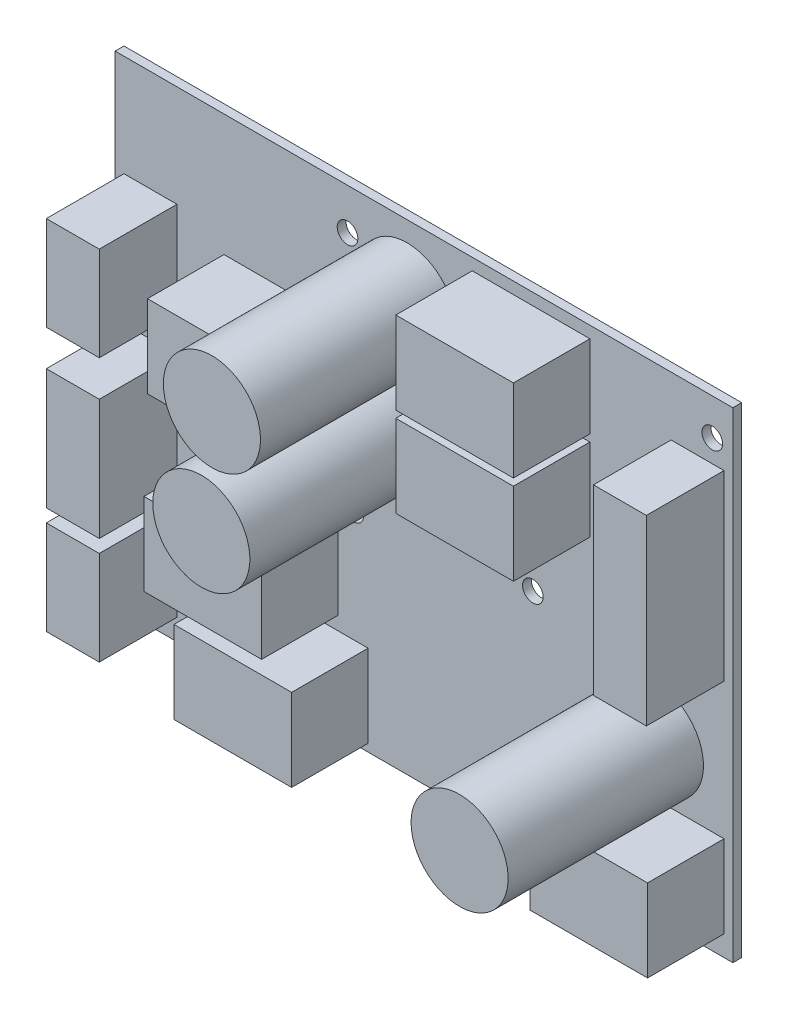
ISO-10303-21;
HEADER;
FILE_DESCRIPTION(('STEP AP214'),'2;1');
FILE_NAME('part.step','',(''),(''),'','','');
FILE_SCHEMA(('AUTOMOTIVE_DESIGN { 1 0 10303 214 1 1 1 1 }'));
ENDSEC;
DATA;
#1=APPLICATION_CONTEXT('core data for automotive mechanical design processes');
#2=APPLICATION_PROTOCOL_DEFINITION('international standard','automotive_design',2000,#1);
#3=PRODUCT_CONTEXT('',#1,'mechanical');
#4=PRODUCT('Part','Part','',(#3));
#5=PRODUCT_RELATED_PRODUCT_CATEGORY('part','',(#4));
#6=PRODUCT_DEFINITION_FORMATION('','',#4);
#7=PRODUCT_DEFINITION_CONTEXT('part definition',#1,'design');
#8=PRODUCT_DEFINITION('design','',#6,#7);
#9=PRODUCT_DEFINITION_SHAPE('','',#8);
#10=(LENGTH_UNIT() NAMED_UNIT(*) SI_UNIT(.MILLI.,.METRE.));
#11=(NAMED_UNIT(*) PLANE_ANGLE_UNIT() SI_UNIT($,.RADIAN.));
#12=(NAMED_UNIT(*) SI_UNIT($,.STERADIAN.) SOLID_ANGLE_UNIT());
#13=UNCERTAINTY_MEASURE_WITH_UNIT(LENGTH_MEASURE(1.E-05),#10,'distance_accuracy_value','');
#14=(GEOMETRIC_REPRESENTATION_CONTEXT(3) GLOBAL_UNCERTAINTY_ASSIGNED_CONTEXT((#13)) GLOBAL_UNIT_ASSIGNED_CONTEXT((#10,
#11,#12)) REPRESENTATION_CONTEXT('',''));
#15=CARTESIAN_POINT('',(0.,0.,0.));
#16=DIRECTION('',(0.,0.,1.));
#17=DIRECTION('',(1.,0.,0.));
#18=AXIS2_PLACEMENT_3D('',#15,#16,#17);
#19=CARTESIAN_POINT('',(0.,0.,1.5));
#20=DIRECTION('',(0.,0.,1.));
#21=DIRECTION('',(1.,0.,0.));
#22=AXIS2_PLACEMENT_3D('',#19,#20,#21);
#23=PLANE('',#22);
#24=CARTESIAN_POINT('',(-42.5440736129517,-241.931746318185,1.5));
#25=DIRECTION('',(0.,0.,1.));
#26=DIRECTION('',(1.,0.,0.));
#27=AXIS2_PLACEMENT_3D('',#24,#25,#26);
#28=CIRCLE('',#27,8.25);
#29=CARTESIAN_POINT('',(-50.7940736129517,-241.931746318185,1.5));
#30=VERTEX_POINT('',#29);
#31=EDGE_CURVE('E760',#30,#30,#28,.T.);
#32=ORIENTED_EDGE('',*,*,#31,.F.);
#33=EDGE_LOOP('',(#32));
#34=FACE_BOUND('',#33,.T.);
#35=DIRECTION('',(1.,0.,0.));
#36=VECTOR('',#35,1.);
#37=CARTESIAN_POINT('',(-8.69407361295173,-308.481746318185,1.5));
#38=LINE('',#37,#36);
#39=CARTESIAN_POINT('',(-8.69407361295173,-308.481746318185,1.5));
#40=VERTEX_POINT('',#39);
#41=CARTESIAN_POINT('',(11.3059263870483,-308.481746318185,1.5));
#42=VERTEX_POINT('',#41);
#43=EDGE_CURVE('E776',#40,#42,#38,.T.);
#44=ORIENTED_EDGE('',*,*,#43,.F.);
#45=DIRECTION('',(0.,-1.,0.));
#46=VECTOR('',#45,1.);
#47=CARTESIAN_POINT('',(-8.69407361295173,-294.481746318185,1.5));
#48=LINE('',#47,#46);
#49=CARTESIAN_POINT('',(-8.69407361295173,-294.481746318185,1.5));
#50=VERTEX_POINT('',#49);
#51=EDGE_CURVE('E356',#50,#40,#48,.T.);
#52=ORIENTED_EDGE('',*,*,#51,.F.);
#53=DIRECTION('',(-1.,0.,0.));
#54=VECTOR('',#53,1.);
#55=CARTESIAN_POINT('',(-8.69407361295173,-294.481746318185,1.5));
#56=LINE('',#55,#54);
#57=CARTESIAN_POINT('',(11.3059263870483,-294.481746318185,1.5));
#58=VERTEX_POINT('',#57);
#59=EDGE_CURVE('E352',#58,#50,#56,.T.);
#60=ORIENTED_EDGE('',*,*,#59,.F.);
#61=DIRECTION('',(0.,1.,0.));
#62=VECTOR('',#61,1.);
#63=CARTESIAN_POINT('',(11.3059263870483,-294.481746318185,1.5));
#64=LINE('',#63,#62);
#65=EDGE_CURVE('E778',#42,#58,#64,.T.);
#66=ORIENTED_EDGE('',*,*,#65,.F.);
#67=EDGE_LOOP('',(#44,#52,#60,#66));
#68=FACE_BOUND('',#67,.T.);
#69=DIRECTION('',(1.,0.,0.));
#70=VECTOR('',#69,1.);
#71=CARTESIAN_POINT('',(-31.4940736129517,-246.281746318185,1.5));
#72=LINE('',#71,#70);
#73=CARTESIAN_POINT('',(-31.4940736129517,-246.281746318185,1.5));
#74=VERTEX_POINT('',#73);
#75=CARTESIAN_POINT('',(-11.4940736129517,-246.281746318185,1.5));
#76=VERTEX_POINT('',#75);
#77=EDGE_CURVE('E403',#74,#76,#72,.T.);
#78=ORIENTED_EDGE('',*,*,#77,.F.);
#79=DIRECTION('',(0.,-1.,0.));
#80=VECTOR('',#79,1.);
#81=CARTESIAN_POINT('',(-31.4940736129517,-232.281746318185,1.5));
#82=LINE('',#81,#80);
#83=CARTESIAN_POINT('',(-31.4940736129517,-232.281746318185,1.5));
#84=VERTEX_POINT('',#83);
#85=EDGE_CURVE('E389',#84,#74,#82,.T.);
#86=ORIENTED_EDGE('',*,*,#85,.F.);
#87=DIRECTION('',(-1.,0.,0.));
#88=VECTOR('',#87,1.);
#89=CARTESIAN_POINT('',(-31.4940736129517,-232.281746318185,1.5));
#90=LINE('',#89,#88);
#91=CARTESIAN_POINT('',(-11.4940736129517,-232.281746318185,1.5));
#92=VERTEX_POINT('',#91);
#93=EDGE_CURVE('E394',#92,#84,#90,.T.);
#94=ORIENTED_EDGE('',*,*,#93,.F.);
#95=DIRECTION('',(0.,1.,0.));
#96=VECTOR('',#95,1.);
#97=CARTESIAN_POINT('',(-11.4940736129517,-232.281746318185,1.5));
#98=LINE('',#97,#96);
#99=EDGE_CURVE('E405',#76,#92,#98,.T.);
#100=ORIENTED_EDGE('',*,*,#99,.F.);
#101=EDGE_LOOP('',(#78,#86,#94,#100));
#102=FACE_BOUND('',#101,.T.);
#103=DIRECTION('',(1.,0.,0.));
#104=VECTOR('',#103,1.);
#105=CARTESIAN_POINT('',(-74.2940736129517,-294.381746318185,1.5));
#106=LINE('',#105,#104);
#107=CARTESIAN_POINT('',(-74.2940736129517,-294.381746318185,1.5));
#108=VERTEX_POINT('',#107);
#109=CARTESIAN_POINT('',(-54.2940736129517,-294.381746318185,1.5));
#110=VERTEX_POINT('',#109);
#111=EDGE_CURVE('E461',#108,#110,#106,.T.);
#112=ORIENTED_EDGE('',*,*,#111,.F.);
#113=DIRECTION('',(0.,-1.,0.));
#114=VECTOR('',#113,1.);
#115=CARTESIAN_POINT('',(-74.2940736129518,-280.381746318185,1.5));
#116=LINE('',#115,#114);
#117=CARTESIAN_POINT('',(-74.2940736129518,-280.381746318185,1.5));
#118=VERTEX_POINT('',#117);
#119=EDGE_CURVE('E447',#118,#108,#116,.T.);
#120=ORIENTED_EDGE('',*,*,#119,.F.);
#121=DIRECTION('',(-1.,0.,0.));
#122=VECTOR('',#121,1.);
#123=CARTESIAN_POINT('',(-74.2940736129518,-280.381746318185,1.5));
#124=LINE('',#123,#122);
#125=CARTESIAN_POINT('',(-54.2940736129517,-280.381746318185,1.5));
#126=VERTEX_POINT('',#125);
#127=EDGE_CURVE('E452',#126,#118,#124,.T.);
#128=ORIENTED_EDGE('',*,*,#127,.F.);
#129=DIRECTION('',(0.,1.,0.));
#130=VECTOR('',#129,1.);
#131=CARTESIAN_POINT('',(-54.2940736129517,-280.381746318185,1.5));
#132=LINE('',#131,#130);
#133=EDGE_CURVE('E463',#110,#126,#132,.T.);
#134=ORIENTED_EDGE('',*,*,#133,.F.);
#135=EDGE_LOOP('',(#112,#120,#128,#134));
#136=FACE_BOUND('',#135,.T.);
#137=DIRECTION('',(-1.,0.,0.));
#138=VECTOR('',#137,1.);
#139=CARTESIAN_POINT('',(2.30592638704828,-240.281746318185,1.5));
#140=LINE('',#139,#138);
#141=CARTESIAN_POINT('',(11.3059263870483,-240.281746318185,1.5));
#142=VERTEX_POINT('',#141);
#143=CARTESIAN_POINT('',(2.30592638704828,-240.281746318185,1.5));
#144=VERTEX_POINT('',#143);
#145=EDGE_CURVE('E519',#142,#144,#140,.T.);
#146=ORIENTED_EDGE('',*,*,#145,.F.);
#147=DIRECTION('',(0.,1.,0.));
#148=VECTOR('',#147,1.);
#149=CARTESIAN_POINT('',(11.3059263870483,-240.281746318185,1.5));
#150=LINE('',#149,#148);
#151=CARTESIAN_POINT('',(11.3059263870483,-271.281746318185,1.5));
#152=VERTEX_POINT('',#151);
#153=EDGE_CURVE('E505',#152,#142,#150,.T.);
#154=ORIENTED_EDGE('',*,*,#153,.F.);
#155=DIRECTION('',(1.,0.,0.));
#156=VECTOR('',#155,1.);
#157=CARTESIAN_POINT('',(2.30592638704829,-271.281746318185,1.5));
#158=LINE('',#157,#156);
#159=CARTESIAN_POINT('',(2.30592638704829,-271.281746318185,1.5));
#160=VERTEX_POINT('',#159);
#161=EDGE_CURVE('E510',#160,#152,#158,.T.);
#162=ORIENTED_EDGE('',*,*,#161,.F.);
#163=DIRECTION('',(0.,-1.,0.));
#164=VECTOR('',#163,1.);
#165=CARTESIAN_POINT('',(2.30592638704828,-240.281746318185,1.5));
#166=LINE('',#165,#164);
#167=EDGE_CURVE('E521',#144,#160,#166,.T.);
#168=ORIENTED_EDGE('',*,*,#167,.F.);
#169=EDGE_LOOP('',(#146,#154,#162,#168));
#170=FACE_BOUND('',#169,.T.);
#171=DIRECTION('',(-1.,0.,0.));
#172=VECTOR('',#171,1.);
#173=CARTESIAN_POINT('',(-90.6940736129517,-269.681746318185,1.5));
#174=LINE('',#173,#172);
#175=CARTESIAN_POINT('',(-81.6940736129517,-269.681746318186,1.5));
#176=VERTEX_POINT('',#175);
#177=CARTESIAN_POINT('',(-90.6940736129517,-269.681746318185,1.5));
#178=VERTEX_POINT('',#177);
#179=EDGE_CURVE('E577',#176,#178,#174,.T.);
#180=ORIENTED_EDGE('',*,*,#179,.F.);
#181=DIRECTION('',(0.,1.,0.));
#182=VECTOR('',#181,1.);
#183=CARTESIAN_POINT('',(-81.6940736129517,-269.681746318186,1.5));
#184=LINE('',#183,#182);
#185=CARTESIAN_POINT('',(-81.6940736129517,-290.181746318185,1.5));
#186=VERTEX_POINT('',#185);
#187=EDGE_CURVE('E563',#186,#176,#184,.T.);
#188=ORIENTED_EDGE('',*,*,#187,.F.);
#189=DIRECTION('',(1.,0.,0.));
#190=VECTOR('',#189,1.);
#191=CARTESIAN_POINT('',(-90.6940736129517,-290.181746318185,1.5));
#192=LINE('',#191,#190);
#193=CARTESIAN_POINT('',(-90.6940736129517,-290.181746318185,1.5));
#194=VERTEX_POINT('',#193);
#195=EDGE_CURVE('E568',#194,#186,#192,.T.);
#196=ORIENTED_EDGE('',*,*,#195,.F.);
#197=DIRECTION('',(0.,-1.,0.));
#198=VECTOR('',#197,1.);
#199=CARTESIAN_POINT('',(-90.6940736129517,-269.681746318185,1.5));
#200=LINE('',#199,#198);
#201=EDGE_CURVE('E579',#178,#194,#200,.T.);
#202=ORIENTED_EDGE('',*,*,#201,.F.);
#203=EDGE_LOOP('',(#180,#188,#196,#202));
#204=FACE_BOUND('',#203,.T.);
#205=CARTESIAN_POINT('',(-51.6940736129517,-277.581746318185,1.5));
#206=DIRECTION('',(0.,0.,1.));
#207=DIRECTION('',(1.,0.,0.));
#208=AXIS2_PLACEMENT_3D('',#205,#206,#207);
#209=CIRCLE('',#208,1.75);
#210=CARTESIAN_POINT('',(-49.9440736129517,-277.581746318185,1.5));
#211=VERTEX_POINT('',#210);
#212=EDGE_CURVE('E622',#211,#211,#209,.T.);
#213=ORIENTED_EDGE('',*,*,#212,.F.);
#214=EDGE_LOOP('',(#213));
#215=FACE_BOUND('',#214,.T.);
#216=CARTESIAN_POINT('',(9.30592638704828,-236.481746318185,1.5));
#217=DIRECTION('',(0.,0.,1.));
#218=DIRECTION('',(1.,0.,0.));
#219=AXIS2_PLACEMENT_3D('',#216,#217,#218);
#220=CIRCLE('',#219,1.75);
#221=CARTESIAN_POINT('',(11.0559263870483,-236.481746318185,1.5));
#222=VERTEX_POINT('',#221);
#223=EDGE_CURVE('E634',#222,#222,#220,.T.);
#224=ORIENTED_EDGE('',*,*,#223,.F.);
#225=EDGE_LOOP('',(#224));
#226=FACE_BOUND('',#225,.T.);
#227=DIRECTION('',(0.,1.,0.));
#228=VECTOR('',#227,1.);
#229=CARTESIAN_POINT('',(12.8059263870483,-230.281746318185,1.5));
#230=LINE('',#229,#228);
#231=CARTESIAN_POINT('',(12.8059263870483,-311.981746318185,1.5));
#232=VERTEX_POINT('',#231);
#233=CARTESIAN_POINT('',(12.8059263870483,-230.281746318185,1.5));
#234=VERTEX_POINT('',#233);
#235=EDGE_CURVE('E646',#232,#234,#230,.T.);
#236=ORIENTED_EDGE('',*,*,#235,.T.);
#237=DIRECTION('',(-1.,0.,0.));
#238=VECTOR('',#237,1.);
#239=CARTESIAN_POINT('',(-92.1940736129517,-230.281746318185,1.5));
#240=LINE('',#239,#238);
#241=CARTESIAN_POINT('',(-92.1940736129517,-230.281746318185,1.5));
#242=VERTEX_POINT('',#241);
#243=EDGE_CURVE('E649',#234,#242,#240,.T.);
#244=ORIENTED_EDGE('',*,*,#243,.T.);
#245=DIRECTION('',(0.,-1.,0.));
#246=VECTOR('',#245,1.);
#247=CARTESIAN_POINT('',(-92.1940736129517,-230.281746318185,1.5));
#248=LINE('',#247,#246);
#249=CARTESIAN_POINT('',(-92.1940736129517,-311.981746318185,1.5));
#250=VERTEX_POINT('',#249);
#251=EDGE_CURVE('E652',#242,#250,#248,.T.);
#252=ORIENTED_EDGE('',*,*,#251,.T.);
#253=DIRECTION('',(1.,0.,0.));
#254=VECTOR('',#253,1.);
#255=CARTESIAN_POINT('',(-92.1940736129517,-311.981746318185,1.5));
#256=LINE('',#255,#254);
#257=EDGE_CURVE('E654',#250,#232,#256,.T.);
#258=ORIENTED_EDGE('',*,*,#257,.T.);
#259=EDGE_LOOP('',(#236,#244,#252,#258));
#260=FACE_BOUND('',#259,.T.);
#261=CARTESIAN_POINT('',(-21.1940736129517,-274.281746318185,1.5));
#262=DIRECTION('',(0.,0.,1.));
#263=DIRECTION('',(1.,0.,0.));
#264=AXIS2_PLACEMENT_3D('',#261,#262,#263);
#265=CIRCLE('',#264,1.75);
#266=CARTESIAN_POINT('',(-19.4440736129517,-274.281746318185,1.5));
#267=VERTEX_POINT('',#266);
#268=EDGE_CURVE('E640',#267,#267,#265,.T.);
#269=ORIENTED_EDGE('',*,*,#268,.F.);
#270=EDGE_LOOP('',(#269));
#271=FACE_BOUND('',#270,.T.);
#272=CARTESIAN_POINT('',(-52.6940736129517,-237.281746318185,1.5));
#273=DIRECTION('',(0.,0.,1.));
#274=DIRECTION('',(1.,0.,0.));
#275=AXIS2_PLACEMENT_3D('',#272,#273,#274);
#276=CIRCLE('',#275,1.75);
#277=CARTESIAN_POINT('',(-50.9440736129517,-237.281746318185,1.5));
#278=VERTEX_POINT('',#277);
#279=EDGE_CURVE('E628',#278,#278,#276,.T.);
#280=ORIENTED_EDGE('',*,*,#279,.F.);
#281=EDGE_LOOP('',(#280));
#282=FACE_BOUND('',#281,.T.);
#283=DIRECTION('',(-1.,0.,0.));
#284=VECTOR('',#283,1.);
#285=CARTESIAN_POINT('',(-90.6940736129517,-247.581746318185,1.5));
#286=LINE('',#285,#284);
#287=CARTESIAN_POINT('',(-81.6940736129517,-247.581746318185,1.5));
#288=VERTEX_POINT('',#287);
#289=CARTESIAN_POINT('',(-90.6940736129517,-247.581746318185,1.5));
#290=VERTEX_POINT('',#289);
#291=EDGE_CURVE('E606',#288,#290,#286,.T.);
#292=ORIENTED_EDGE('',*,*,#291,.F.);
#293=DIRECTION('',(0.,1.,0.));
#294=VECTOR('',#293,1.);
#295=CARTESIAN_POINT('',(-81.6940736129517,-247.581746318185,1.5));
#296=LINE('',#295,#294);
#297=CARTESIAN_POINT('',(-81.6940736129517,-263.581746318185,1.5));
#298=VERTEX_POINT('',#297);
#299=EDGE_CURVE('E592',#298,#288,#296,.T.);
#300=ORIENTED_EDGE('',*,*,#299,.F.);
#301=DIRECTION('',(1.,0.,0.));
#302=VECTOR('',#301,1.);
#303=CARTESIAN_POINT('',(-90.6940736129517,-263.581746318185,1.5));
#304=LINE('',#303,#302);
#305=CARTESIAN_POINT('',(-90.6940736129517,-263.581746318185,1.5));
#306=VERTEX_POINT('',#305);
#307=EDGE_CURVE('E597',#306,#298,#304,.T.);
#308=ORIENTED_EDGE('',*,*,#307,.F.);
#309=DIRECTION('',(0.,-1.,0.));
#310=VECTOR('',#309,1.);
#311=CARTESIAN_POINT('',(-90.6940736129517,-247.581746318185,1.5));
#312=LINE('',#311,#310);
#313=EDGE_CURVE('E608',#290,#306,#312,.T.);
#314=ORIENTED_EDGE('',*,*,#313,.F.);
#315=EDGE_LOOP('',(#292,#300,#308,#314));
#316=FACE_BOUND('',#315,.T.);
#317=DIRECTION('',(-1.,0.,0.));
#318=VECTOR('',#317,1.);
#319=CARTESIAN_POINT('',(-90.6940736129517,-292.381746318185,1.5));
#320=LINE('',#319,#318);
#321=CARTESIAN_POINT('',(-81.6940736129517,-292.381746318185,1.5));
#322=VERTEX_POINT('',#321);
#323=CARTESIAN_POINT('',(-90.6940736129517,-292.381746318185,1.5));
#324=VERTEX_POINT('',#323);
#325=EDGE_CURVE('E548',#322,#324,#320,.T.);
#326=ORIENTED_EDGE('',*,*,#325,.F.);
#327=DIRECTION('',(0.,1.,0.));
#328=VECTOR('',#327,1.);
#329=CARTESIAN_POINT('',(-81.6940736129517,-292.381746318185,1.5));
#330=LINE('',#329,#328);
#331=CARTESIAN_POINT('',(-81.6940736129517,-308.381746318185,1.5));
#332=VERTEX_POINT('',#331);
#333=EDGE_CURVE('E534',#332,#322,#330,.T.);
#334=ORIENTED_EDGE('',*,*,#333,.F.);
#335=DIRECTION('',(1.,0.,0.));
#336=VECTOR('',#335,1.);
#337=CARTESIAN_POINT('',(-90.6940736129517,-308.381746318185,1.5));
#338=LINE('',#337,#336);
#339=CARTESIAN_POINT('',(-90.6940736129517,-308.381746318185,1.5));
#340=VERTEX_POINT('',#339);
#341=EDGE_CURVE('E539',#340,#332,#338,.T.);
#342=ORIENTED_EDGE('',*,*,#341,.F.);
#343=DIRECTION('',(0.,-1.,0.));
#344=VECTOR('',#343,1.);
#345=CARTESIAN_POINT('',(-90.6940736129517,-292.381746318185,1.5));
#346=LINE('',#345,#344);
#347=EDGE_CURVE('E550',#324,#340,#346,.T.);
#348=ORIENTED_EDGE('',*,*,#347,.F.);
#349=EDGE_LOOP('',(#326,#334,#342,#348));
#350=FACE_BOUND('',#349,.T.);
#351=DIRECTION('',(-1.,0.,0.));
#352=VECTOR('',#351,1.);
#353=CARTESIAN_POINT('',(-73.6940736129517,-250.981746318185,1.5));
#354=LINE('',#353,#352);
#355=CARTESIAN_POINT('',(-53.6940736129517,-250.981746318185,1.5));
#356=VERTEX_POINT('',#355);
#357=CARTESIAN_POINT('',(-73.6940736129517,-250.981746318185,1.5));
#358=VERTEX_POINT('',#357);
#359=EDGE_CURVE('E490',#356,#358,#354,.T.);
#360=ORIENTED_EDGE('',*,*,#359,.F.);
#361=DIRECTION('',(0.,1.,0.));
#362=VECTOR('',#361,1.);
#363=CARTESIAN_POINT('',(-53.6940736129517,-250.981746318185,1.5));
#364=LINE('',#363,#362);
#365=CARTESIAN_POINT('',(-53.6940736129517,-264.981746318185,1.5));
#366=VERTEX_POINT('',#365);
#367=EDGE_CURVE('E476',#366,#356,#364,.T.);
#368=ORIENTED_EDGE('',*,*,#367,.F.);
#369=DIRECTION('',(1.,0.,0.));
#370=VECTOR('',#369,1.);
#371=CARTESIAN_POINT('',(-73.6940736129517,-264.981746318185,1.5));
#372=LINE('',#371,#370);
#373=CARTESIAN_POINT('',(-73.6940736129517,-264.981746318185,1.5));
#374=VERTEX_POINT('',#373);
#375=EDGE_CURVE('E481',#374,#366,#372,.T.);
#376=ORIENTED_EDGE('',*,*,#375,.F.);
#377=DIRECTION('',(0.,-1.,0.));
#378=VECTOR('',#377,1.);
#379=CARTESIAN_POINT('',(-73.6940736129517,-250.981746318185,1.5));
#380=LINE('',#379,#378);
#381=EDGE_CURVE('E492',#358,#374,#380,.T.);
#382=ORIENTED_EDGE('',*,*,#381,.F.);
#383=EDGE_LOOP('',(#360,#368,#376,#382));
#384=FACE_BOUND('',#383,.T.);
#385=DIRECTION('',(1.,0.,0.));
#386=VECTOR('',#385,1.);
#387=CARTESIAN_POINT('',(-69.1940736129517,-310.681746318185,1.5));
#388=LINE('',#387,#386);
#389=CARTESIAN_POINT('',(-69.1940736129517,-310.681746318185,1.5));
#390=VERTEX_POINT('',#389);
#391=CARTESIAN_POINT('',(-49.1940736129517,-310.681746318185,1.5));
#392=VERTEX_POINT('',#391);
#393=EDGE_CURVE('E432',#390,#392,#388,.T.);
#394=ORIENTED_EDGE('',*,*,#393,.F.);
#395=DIRECTION('',(0.,-1.,0.));
#396=VECTOR('',#395,1.);
#397=CARTESIAN_POINT('',(-69.1940736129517,-296.681746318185,1.5));
#398=LINE('',#397,#396);
#399=CARTESIAN_POINT('',(-69.1940736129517,-296.681746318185,1.5));
#400=VERTEX_POINT('',#399);
#401=EDGE_CURVE('E418',#400,#390,#398,.T.);
#402=ORIENTED_EDGE('',*,*,#401,.F.);
#403=DIRECTION('',(-1.,0.,0.));
#404=VECTOR('',#403,1.);
#405=CARTESIAN_POINT('',(-69.1940736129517,-296.681746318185,1.5));
#406=LINE('',#405,#404);
#407=CARTESIAN_POINT('',(-49.1940736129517,-296.681746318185,1.5));
#408=VERTEX_POINT('',#407);
#409=EDGE_CURVE('E423',#408,#400,#406,.T.);
#410=ORIENTED_EDGE('',*,*,#409,.F.);
#411=DIRECTION('',(0.,1.,0.));
#412=VECTOR('',#411,1.);
#413=CARTESIAN_POINT('',(-49.1940736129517,-296.681746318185,1.5));
#414=LINE('',#413,#412);
#415=EDGE_CURVE('E434',#392,#408,#414,.T.);
#416=ORIENTED_EDGE('',*,*,#415,.F.);
#417=EDGE_LOOP('',(#394,#402,#410,#416));
#418=FACE_BOUND('',#417,.T.);
#419=DIRECTION('',(1.,0.,0.));
#420=VECTOR('',#419,1.);
#421=CARTESIAN_POINT('',(-31.4940736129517,-261.481746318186,1.5));
#422=LINE('',#421,#420);
#423=CARTESIAN_POINT('',(-31.4940736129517,-261.481746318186,1.5));
#424=VERTEX_POINT('',#423);
#425=CARTESIAN_POINT('',(-11.4940736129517,-261.481746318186,1.5));
#426=VERTEX_POINT('',#425);
#427=EDGE_CURVE('E361',#424,#426,#422,.T.);
#428=ORIENTED_EDGE('',*,*,#427,.F.);
#429=DIRECTION('',(0.,-1.,0.));
#430=VECTOR('',#429,1.);
#431=CARTESIAN_POINT('',(-31.4940736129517,-247.481746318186,1.5));
#432=LINE('',#431,#430);
#433=CARTESIAN_POINT('',(-31.4940736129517,-247.481746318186,1.5));
#434=VERTEX_POINT('',#433);
#435=EDGE_CURVE('E358',#434,#424,#432,.T.);
#436=ORIENTED_EDGE('',*,*,#435,.F.);
#437=DIRECTION('',(-1.,0.,0.));
#438=VECTOR('',#437,1.);
#439=CARTESIAN_POINT('',(-31.4940736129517,-247.481746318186,1.5));
#440=LINE('',#439,#438);
#441=CARTESIAN_POINT('',(-11.4940736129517,-247.481746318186,1.5));
#442=VERTEX_POINT('',#441);
#443=EDGE_CURVE('E370',#442,#434,#440,.T.);
#444=ORIENTED_EDGE('',*,*,#443,.F.);
#445=DIRECTION('',(0.,1.,0.));
#446=VECTOR('',#445,1.);
#447=CARTESIAN_POINT('',(-11.4940736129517,-247.481746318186,1.5));
#448=LINE('',#447,#446);
#449=EDGE_CURVE('E378',#426,#442,#448,.T.);
#450=ORIENTED_EDGE('',*,*,#449,.F.);
#451=EDGE_LOOP('',(#428,#436,#444,#450));
#452=FACE_BOUND('',#451,.T.);
#453=CARTESIAN_POINT('',(-0.444073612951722,-285.481746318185,1.5));
#454=DIRECTION('',(0.,0.,1.));
#455=DIRECTION('',(1.,0.,0.));
#456=AXIS2_PLACEMENT_3D('',#453,#454,#455);
#457=CIRCLE('',#456,8.25000000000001);
#458=CARTESIAN_POINT('',(-8.69407361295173,-285.481746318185,1.5));
#459=VERTEX_POINT('',#458);
#460=EDGE_CURVE('E752',#459,#459,#457,.T.);
#461=ORIENTED_EDGE('',*,*,#460,.F.);
#462=EDGE_LOOP('',(#461));
#463=FACE_BOUND('',#462,.T.);
#464=CARTESIAN_POINT('',(-44.3440736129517,-260.431746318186,1.5));
#465=DIRECTION('',(0.,0.,1.));
#466=DIRECTION('',(1.,0.,0.));
#467=AXIS2_PLACEMENT_3D('',#464,#465,#466);
#468=CIRCLE('',#467,8.25);
#469=CARTESIAN_POINT('',(-52.5940736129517,-260.431746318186,1.5));
#470=VERTEX_POINT('',#469);
#471=EDGE_CURVE('E755',#470,#470,#468,.T.);
#472=ORIENTED_EDGE('',*,*,#471,.F.);
#473=EDGE_LOOP('',(#472));
#474=FACE_BOUND('',#473,.T.);
#475=ADVANCED_FACE('F51',(#34,#68,#102,#136,#170,#204,#215,#226,#260,#271,#282,#316,#350,#384,
#418,#452,#463,#474),#23,.T.);
#476=CARTESIAN_POINT('',(0.,0.,0.));
#477=DIRECTION('',(0.,0.,1.));
#478=DIRECTION('',(1.,0.,0.));
#479=AXIS2_PLACEMENT_3D('',#476,#477,#478);
#480=PLANE('',#479);
#481=CARTESIAN_POINT('',(-52.6940736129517,-237.281746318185,0.));
#482=DIRECTION('',(0.,0.,1.));
#483=DIRECTION('',(1.,0.,0.));
#484=AXIS2_PLACEMENT_3D('',#481,#482,#483);
#485=CIRCLE('',#484,1.75);
#486=CARTESIAN_POINT('',(-50.9440736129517,-237.281746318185,0.));
#487=VERTEX_POINT('',#486);
#488=EDGE_CURVE('E625',#487,#487,#485,.T.);
#489=ORIENTED_EDGE('',*,*,#488,.T.);
#490=EDGE_LOOP('',(#489));
#491=FACE_BOUND('',#490,.T.);
#492=CARTESIAN_POINT('',(-21.1940736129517,-274.281746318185,0.));
#493=DIRECTION('',(0.,0.,1.));
#494=DIRECTION('',(1.,0.,0.));
#495=AXIS2_PLACEMENT_3D('',#492,#493,#494);
#496=CIRCLE('',#495,1.75);
#497=CARTESIAN_POINT('',(-19.4440736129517,-274.281746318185,0.));
#498=VERTEX_POINT('',#497);
#499=EDGE_CURVE('E637',#498,#498,#496,.T.);
#500=ORIENTED_EDGE('',*,*,#499,.T.);
#501=EDGE_LOOP('',(#500));
#502=FACE_BOUND('',#501,.T.);
#503=DIRECTION('',(0.,1.,0.));
#504=VECTOR('',#503,1.);
#505=CARTESIAN_POINT('',(12.8059263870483,-230.281746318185,0.));
#506=LINE('',#505,#504);
#507=CARTESIAN_POINT('',(12.8059263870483,-311.981746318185,0.));
#508=VERTEX_POINT('',#507);
#509=CARTESIAN_POINT('',(12.8059263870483,-230.281746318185,0.));
#510=VERTEX_POINT('',#509);
#511=EDGE_CURVE('E643',#508,#510,#506,.T.);
#512=ORIENTED_EDGE('',*,*,#511,.F.);
#513=DIRECTION('',(1.,0.,0.));
#514=VECTOR('',#513,1.);
#515=CARTESIAN_POINT('',(-92.1940736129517,-311.981746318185,0.));
#516=LINE('',#515,#514);
#517=CARTESIAN_POINT('',(-92.1940736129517,-311.981746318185,0.));
#518=VERTEX_POINT('',#517);
#519=EDGE_CURVE('E650',#518,#508,#516,.T.);
#520=ORIENTED_EDGE('',*,*,#519,.F.);
#521=DIRECTION('',(0.,-1.,0.));
#522=VECTOR('',#521,1.);
#523=CARTESIAN_POINT('',(-92.1940736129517,-230.281746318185,0.));
#524=LINE('',#523,#522);
#525=CARTESIAN_POINT('',(-92.1940736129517,-230.281746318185,0.));
#526=VERTEX_POINT('',#525);
#527=EDGE_CURVE('E661',#526,#518,#524,.T.);
#528=ORIENTED_EDGE('',*,*,#527,.F.);
#529=DIRECTION('',(-1.,0.,0.));
#530=VECTOR('',#529,1.);
#531=CARTESIAN_POINT('',(-92.1940736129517,-230.281746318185,0.));
#532=LINE('',#531,#530);
#533=EDGE_CURVE('E659',#510,#526,#532,.T.);
#534=ORIENTED_EDGE('',*,*,#533,.F.);
#535=EDGE_LOOP('',(#512,#520,#528,#534));
#536=FACE_BOUND('',#535,.T.);
#537=CARTESIAN_POINT('',(9.30592638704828,-236.481746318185,0.));
#538=DIRECTION('',(0.,0.,1.));
#539=DIRECTION('',(1.,0.,0.));
#540=AXIS2_PLACEMENT_3D('',#537,#538,#539);
#541=CIRCLE('',#540,1.75);
#542=CARTESIAN_POINT('',(11.0559263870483,-236.481746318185,0.));
#543=VERTEX_POINT('',#542);
#544=EDGE_CURVE('E631',#543,#543,#541,.T.);
#545=ORIENTED_EDGE('',*,*,#544,.T.);
#546=EDGE_LOOP('',(#545));
#547=FACE_BOUND('',#546,.T.);
#548=CARTESIAN_POINT('',(-51.6940736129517,-277.581746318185,0.));
#549=DIRECTION('',(0.,0.,1.));
#550=DIRECTION('',(1.,0.,0.));
#551=AXIS2_PLACEMENT_3D('',#548,#549,#550);
#552=CIRCLE('',#551,1.75);
#553=CARTESIAN_POINT('',(-49.9440736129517,-277.581746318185,0.));
#554=VERTEX_POINT('',#553);
#555=EDGE_CURVE('E621',#554,#554,#552,.T.);
#556=ORIENTED_EDGE('',*,*,#555,.T.);
#557=EDGE_LOOP('',(#556));
#558=FACE_BOUND('',#557,.T.);
#559=ADVANCED_FACE('F679',(#491,#502,#536,#547,#558),#480,.F.);
#560=CARTESIAN_POINT('',(12.8059263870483,-230.281746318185,1.5));
#561=DIRECTION('',(-1.,0.,0.));
#562=DIRECTION('',(0.,0.,1.));
#563=AXIS2_PLACEMENT_3D('',#560,#561,#562);
#564=PLANE('',#563);
#565=ORIENTED_EDGE('',*,*,#511,.T.);
#566=DIRECTION('',(0.,0.,-1.));
#567=VECTOR('',#566,1.);
#568=CARTESIAN_POINT('',(12.8059263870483,-230.281746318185,1.5));
#569=LINE('',#568,#567);
#570=EDGE_CURVE('E13',#234,#510,#569,.T.);
#571=ORIENTED_EDGE('',*,*,#570,.F.);
#572=ORIENTED_EDGE('',*,*,#235,.F.);
#573=DIRECTION('',(0.,0.,-1.));
#574=VECTOR('',#573,1.);
#575=CARTESIAN_POINT('',(12.8059263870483,-311.981746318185,1.5));
#576=LINE('',#575,#574);
#577=EDGE_CURVE('E656',#232,#508,#576,.T.);
#578=ORIENTED_EDGE('',*,*,#577,.T.);
#579=EDGE_LOOP('',(#565,#571,#572,#578));
#580=FACE_BOUND('',#579,.T.);
#581=ADVANCED_FACE('F53',(#580),#564,.F.);
#582=CARTESIAN_POINT('',(-92.1940736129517,-230.281746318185,1.5));
#583=DIRECTION('',(0.,-1.,0.));
#584=DIRECTION('',(0.,0.,-1.));
#585=AXIS2_PLACEMENT_3D('',#582,#583,#584);
#586=PLANE('',#585);
#587=ORIENTED_EDGE('',*,*,#533,.T.);
#588=DIRECTION('',(0.,0.,-1.));
#589=VECTOR('',#588,1.);
#590=CARTESIAN_POINT('',(-92.1940736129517,-230.281746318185,1.5));
#591=LINE('',#590,#589);
#592=EDGE_CURVE('E59',#242,#526,#591,.T.);
#593=ORIENTED_EDGE('',*,*,#592,.F.);
#594=ORIENTED_EDGE('',*,*,#243,.F.);
#595=ORIENTED_EDGE('',*,*,#570,.T.);
#596=EDGE_LOOP('',(#587,#593,#594,#595));
#597=FACE_BOUND('',#596,.T.);
#598=ADVANCED_FACE('F690',(#597),#586,.F.);
#599=CARTESIAN_POINT('',(-92.1940736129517,-230.281746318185,1.5));
#600=DIRECTION('',(1.,0.,0.));
#601=DIRECTION('',(0.,0.,-1.));
#602=AXIS2_PLACEMENT_3D('',#599,#600,#601);
#603=PLANE('',#602);
#604=ORIENTED_EDGE('',*,*,#527,.T.);
#605=DIRECTION('',(0.,0.,-1.));
#606=VECTOR('',#605,1.);
#607=CARTESIAN_POINT('',(-92.1940736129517,-311.981746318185,1.5));
#608=LINE('',#607,#606);
#609=EDGE_CURVE('E666',#250,#518,#608,.T.);
#610=ORIENTED_EDGE('',*,*,#609,.F.);
#611=ORIENTED_EDGE('',*,*,#251,.F.);
#612=ORIENTED_EDGE('',*,*,#592,.T.);
#613=EDGE_LOOP('',(#604,#610,#611,#612));
#614=FACE_BOUND('',#613,.T.);
#615=ADVANCED_FACE('F673',(#614),#603,.F.);
#616=CARTESIAN_POINT('',(-92.1940736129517,-311.981746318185,1.5));
#617=DIRECTION('',(0.,1.,0.));
#618=DIRECTION('',(-1.,0.,0.));
#619=AXIS2_PLACEMENT_3D('',#616,#617,#618);
#620=PLANE('',#619);
#621=ORIENTED_EDGE('',*,*,#519,.T.);
#622=ORIENTED_EDGE('',*,*,#577,.F.);
#623=ORIENTED_EDGE('',*,*,#257,.F.);
#624=ORIENTED_EDGE('',*,*,#609,.T.);
#625=EDGE_LOOP('',(#621,#622,#623,#624));
#626=FACE_BOUND('',#625,.T.);
#627=ADVANCED_FACE('F683',(#626),#620,.F.);
#628=CARTESIAN_POINT('',(-21.1940736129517,-274.281746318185,1.5));
#629=DIRECTION('',(0.,0.,-1.));
#630=DIRECTION('',(-1.,0.,0.));
#631=AXIS2_PLACEMENT_3D('',#628,#629,#630);
#632=CYLINDRICAL_SURFACE('',#631,1.75);
#633=ORIENTED_EDGE('',*,*,#268,.T.);
#634=EDGE_LOOP('',(#633));
#635=FACE_BOUND('',#634,.T.);
#636=ORIENTED_EDGE('',*,*,#499,.F.);
#637=EDGE_LOOP('',(#636));
#638=FACE_BOUND('',#637,.T.);
#639=ADVANCED_FACE('F708',(#635,#638),#632,.F.);
#640=CARTESIAN_POINT('',(9.30592638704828,-236.481746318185,1.5));
#641=DIRECTION('',(0.,0.,-1.));
#642=DIRECTION('',(-1.,0.,0.));
#643=AXIS2_PLACEMENT_3D('',#640,#641,#642);
#644=CYLINDRICAL_SURFACE('',#643,1.75);
#645=ORIENTED_EDGE('',*,*,#223,.T.);
#646=EDGE_LOOP('',(#645));
#647=FACE_BOUND('',#646,.T.);
#648=ORIENTED_EDGE('',*,*,#544,.F.);
#649=EDGE_LOOP('',(#648));
#650=FACE_BOUND('',#649,.T.);
#651=ADVANCED_FACE('F715',(#647,#650),#644,.F.);
#652=CARTESIAN_POINT('',(-52.6940736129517,-237.281746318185,1.5));
#653=DIRECTION('',(0.,0.,-1.));
#654=DIRECTION('',(-1.,0.,0.));
#655=AXIS2_PLACEMENT_3D('',#652,#653,#654);
#656=CYLINDRICAL_SURFACE('',#655,1.75);
#657=ORIENTED_EDGE('',*,*,#279,.T.);
#658=EDGE_LOOP('',(#657));
#659=FACE_BOUND('',#658,.T.);
#660=ORIENTED_EDGE('',*,*,#488,.F.);
#661=EDGE_LOOP('',(#660));
#662=FACE_BOUND('',#661,.T.);
#663=ADVANCED_FACE('F720',(#659,#662),#656,.F.);
#664=CARTESIAN_POINT('',(-51.6940736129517,-277.581746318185,1.5));
#665=DIRECTION('',(0.,0.,-1.));
#666=DIRECTION('',(-1.,0.,0.));
#667=AXIS2_PLACEMENT_3D('',#664,#665,#666);
#668=CYLINDRICAL_SURFACE('',#667,1.75);
#669=ORIENTED_EDGE('',*,*,#212,.T.);
#670=EDGE_LOOP('',(#669));
#671=FACE_BOUND('',#670,.T.);
#672=ORIENTED_EDGE('',*,*,#555,.F.);
#673=EDGE_LOOP('',(#672));
#674=FACE_BOUND('',#673,.T.);
#675=ADVANCED_FACE('F980',(#671,#674),#668,.F.);
#676=CARTESIAN_POINT('',(-81.6940736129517,-247.581746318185,14.7));
#677=DIRECTION('',(-1.,0.,0.));
#678=DIRECTION('',(0.,0.,1.));
#679=AXIS2_PLACEMENT_3D('',#676,#677,#678);
#680=PLANE('',#679);
#681=ORIENTED_EDGE('',*,*,#299,.T.);
#682=DIRECTION('',(0.,0.,-1.));
#683=VECTOR('',#682,1.);
#684=CARTESIAN_POINT('',(-81.6940736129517,-247.581746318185,14.7));
#685=LINE('',#684,#683);
#686=CARTESIAN_POINT('',(-81.6940736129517,-247.581746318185,14.7));
#687=VERTEX_POINT('',#686);
#688=EDGE_CURVE('E619',#687,#288,#685,.T.);
#689=ORIENTED_EDGE('',*,*,#688,.F.);
#690=DIRECTION('',(0.,1.,0.));
#691=VECTOR('',#690,1.);
#692=CARTESIAN_POINT('',(-81.6940736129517,-247.581746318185,14.7));
#693=LINE('',#692,#691);
#694=CARTESIAN_POINT('',(-81.6940736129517,-263.581746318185,14.7));
#695=VERTEX_POINT('',#694);
#696=EDGE_CURVE('E593',#695,#687,#693,.T.);
#697=ORIENTED_EDGE('',*,*,#696,.F.);
#698=DIRECTION('',(0.,0.,-1.));
#699=VECTOR('',#698,1.);
#700=CARTESIAN_POINT('',(-81.6940736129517,-263.581746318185,14.7));
#701=LINE('',#700,#699);
#702=EDGE_CURVE('E603',#695,#298,#701,.T.);
#703=ORIENTED_EDGE('',*,*,#702,.T.);
#704=EDGE_LOOP('',(#681,#689,#697,#703));
#705=FACE_BOUND('',#704,.T.);
#706=ADVANCED_FACE('F976',(#705),#680,.F.);
#707=CARTESIAN_POINT('',(-90.6940736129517,-247.581746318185,14.7));
#708=DIRECTION('',(0.,-1.,0.));
#709=DIRECTION('',(0.,0.,-1.));
#710=AXIS2_PLACEMENT_3D('',#707,#708,#709);
#711=PLANE('',#710);
#712=ORIENTED_EDGE('',*,*,#291,.T.);
#713=DIRECTION('',(0.,0.,-1.));
#714=VECTOR('',#713,1.);
#715=CARTESIAN_POINT('',(-90.6940736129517,-247.581746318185,14.7));
#716=LINE('',#715,#714);
#717=CARTESIAN_POINT('',(-90.6940736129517,-247.581746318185,14.7));
#718=VERTEX_POINT('',#717);
#719=EDGE_CURVE('E616',#718,#290,#716,.T.);
#720=ORIENTED_EDGE('',*,*,#719,.F.);
#721=DIRECTION('',(-1.,0.,0.));
#722=VECTOR('',#721,1.);
#723=CARTESIAN_POINT('',(-90.6940736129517,-247.581746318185,14.7));
#724=LINE('',#723,#722);
#725=EDGE_CURVE('E596',#687,#718,#724,.T.);
#726=ORIENTED_EDGE('',*,*,#725,.F.);
#727=ORIENTED_EDGE('',*,*,#688,.T.);
#728=EDGE_LOOP('',(#712,#720,#726,#727));
#729=FACE_BOUND('',#728,.T.);
#730=ADVANCED_FACE('F972',(#729),#711,.F.);
#731=CARTESIAN_POINT('',(-90.6940736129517,-247.581746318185,14.7));
#732=DIRECTION('',(1.,0.,0.));
#733=DIRECTION('',(0.,0.,-1.));
#734=AXIS2_PLACEMENT_3D('',#731,#732,#733);
#735=PLANE('',#734);
#736=ORIENTED_EDGE('',*,*,#313,.T.);
#737=DIRECTION('',(0.,0.,-1.));
#738=VECTOR('',#737,1.);
#739=CARTESIAN_POINT('',(-90.6940736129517,-263.581746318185,14.7));
#740=LINE('',#739,#738);
#741=CARTESIAN_POINT('',(-90.6940736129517,-263.581746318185,14.7));
#742=VERTEX_POINT('',#741);
#743=EDGE_CURVE('E614',#742,#306,#740,.T.);
#744=ORIENTED_EDGE('',*,*,#743,.F.);
#745=DIRECTION('',(0.,-1.,0.));
#746=VECTOR('',#745,1.);
#747=CARTESIAN_POINT('',(-90.6940736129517,-247.581746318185,14.7));
#748=LINE('',#747,#746);
#749=EDGE_CURVE('E599',#718,#742,#748,.T.);
#750=ORIENTED_EDGE('',*,*,#749,.F.);
#751=ORIENTED_EDGE('',*,*,#719,.T.);
#752=EDGE_LOOP('',(#736,#744,#750,#751));
#753=FACE_BOUND('',#752,.T.);
#754=ADVANCED_FACE('F968',(#753),#735,.F.);
#755=CARTESIAN_POINT('',(-90.6940736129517,-263.581746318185,14.7));
#756=DIRECTION('',(0.,1.,0.));
#757=DIRECTION('',(0.,0.,1.));
#758=AXIS2_PLACEMENT_3D('',#755,#756,#757);
#759=PLANE('',#758);
#760=ORIENTED_EDGE('',*,*,#307,.T.);
#761=ORIENTED_EDGE('',*,*,#702,.F.);
#762=DIRECTION('',(1.,0.,0.));
#763=VECTOR('',#762,1.);
#764=CARTESIAN_POINT('',(-90.6940736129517,-263.581746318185,14.7));
#765=LINE('',#764,#763);
#766=EDGE_CURVE('E601',#742,#695,#765,.T.);
#767=ORIENTED_EDGE('',*,*,#766,.F.);
#768=ORIENTED_EDGE('',*,*,#743,.T.);
#769=EDGE_LOOP('',(#760,#761,#767,#768));
#770=FACE_BOUND('',#769,.T.);
#771=ADVANCED_FACE('F964',(#770),#759,.F.);
#772=CARTESIAN_POINT('',(0.,0.,14.7));
#773=DIRECTION('',(0.,0.,1.));
#774=DIRECTION('',(1.,0.,0.));
#775=AXIS2_PLACEMENT_3D('',#772,#773,#774);
#776=PLANE('',#775);
#777=ORIENTED_EDGE('',*,*,#696,.T.);
#778=ORIENTED_EDGE('',*,*,#725,.T.);
#779=ORIENTED_EDGE('',*,*,#749,.T.);
#780=ORIENTED_EDGE('',*,*,#766,.T.);
#781=EDGE_LOOP('',(#777,#778,#779,#780));
#782=FACE_BOUND('',#781,.T.);
#783=ADVANCED_FACE('F960',(#782),#776,.T.);
#784=CARTESIAN_POINT('',(-81.6940736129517,-269.681746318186,14.7));
#785=DIRECTION('',(-1.,0.,0.));
#786=DIRECTION('',(0.,0.,1.));
#787=AXIS2_PLACEMENT_3D('',#784,#785,#786);
#788=PLANE('',#787);
#789=ORIENTED_EDGE('',*,*,#187,.T.);
#790=DIRECTION('',(0.,0.,-1.));
#791=VECTOR('',#790,1.);
#792=CARTESIAN_POINT('',(-81.6940736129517,-269.681746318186,14.7));
#793=LINE('',#792,#791);
#794=CARTESIAN_POINT('',(-81.6940736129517,-269.681746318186,14.7));
#795=VERTEX_POINT('',#794);
#796=EDGE_CURVE('E590',#795,#176,#793,.T.);
#797=ORIENTED_EDGE('',*,*,#796,.F.);
#798=DIRECTION('',(0.,1.,0.));
#799=VECTOR('',#798,1.);
#800=CARTESIAN_POINT('',(-81.6940736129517,-269.681746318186,14.7));
#801=LINE('',#800,#799);
#802=CARTESIAN_POINT('',(-81.6940736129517,-290.181746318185,14.7));
#803=VERTEX_POINT('',#802);
#804=EDGE_CURVE('E564',#803,#795,#801,.T.);
#805=ORIENTED_EDGE('',*,*,#804,.F.);
#806=DIRECTION('',(0.,0.,-1.));
#807=VECTOR('',#806,1.);
#808=CARTESIAN_POINT('',(-81.6940736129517,-290.181746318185,14.7));
#809=LINE('',#808,#807);
#810=EDGE_CURVE('E574',#803,#186,#809,.T.);
#811=ORIENTED_EDGE('',*,*,#810,.T.);
#812=EDGE_LOOP('',(#789,#797,#805,#811));
#813=FACE_BOUND('',#812,.T.);
#814=ADVANCED_FACE('F956',(#813),#788,.F.);
#815=CARTESIAN_POINT('',(-90.6940736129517,-269.681746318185,14.7));
#816=DIRECTION('',(0.,-1.,0.));
#817=DIRECTION('',(1.,0.,0.));
#818=AXIS2_PLACEMENT_3D('',#815,#816,#817);
#819=PLANE('',#818);
#820=ORIENTED_EDGE('',*,*,#179,.T.);
#821=DIRECTION('',(0.,0.,-1.));
#822=VECTOR('',#821,1.);
#823=CARTESIAN_POINT('',(-90.6940736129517,-269.681746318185,14.7));
#824=LINE('',#823,#822);
#825=CARTESIAN_POINT('',(-90.6940736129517,-269.681746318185,14.7));
#826=VERTEX_POINT('',#825);
#827=EDGE_CURVE('E587',#826,#178,#824,.T.);
#828=ORIENTED_EDGE('',*,*,#827,.F.);
#829=DIRECTION('',(-1.,0.,0.));
#830=VECTOR('',#829,1.);
#831=CARTESIAN_POINT('',(-90.6940736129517,-269.681746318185,14.7));
#832=LINE('',#831,#830);
#833=EDGE_CURVE('E567',#795,#826,#832,.T.);
#834=ORIENTED_EDGE('',*,*,#833,.F.);
#835=ORIENTED_EDGE('',*,*,#796,.T.);
#836=EDGE_LOOP('',(#820,#828,#834,#835));
#837=FACE_BOUND('',#836,.T.);
#838=ADVANCED_FACE('F952',(#837),#819,.F.);
#839=CARTESIAN_POINT('',(-90.6940736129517,-269.681746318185,14.7));
#840=DIRECTION('',(1.,0.,0.));
#841=DIRECTION('',(0.,0.,-1.));
#842=AXIS2_PLACEMENT_3D('',#839,#840,#841);
#843=PLANE('',#842);
#844=ORIENTED_EDGE('',*,*,#201,.T.);
#845=DIRECTION('',(0.,0.,-1.));
#846=VECTOR('',#845,1.);
#847=CARTESIAN_POINT('',(-90.6940736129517,-290.181746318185,14.7));
#848=LINE('',#847,#846);
#849=CARTESIAN_POINT('',(-90.6940736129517,-290.181746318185,14.7));
#850=VERTEX_POINT('',#849);
#851=EDGE_CURVE('E585',#850,#194,#848,.T.);
#852=ORIENTED_EDGE('',*,*,#851,.F.);
#853=DIRECTION('',(0.,-1.,0.));
#854=VECTOR('',#853,1.);
#855=CARTESIAN_POINT('',(-90.6940736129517,-269.681746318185,14.7));
#856=LINE('',#855,#854);
#857=EDGE_CURVE('E570',#826,#850,#856,.T.);
#858=ORIENTED_EDGE('',*,*,#857,.F.);
#859=ORIENTED_EDGE('',*,*,#827,.T.);
#860=EDGE_LOOP('',(#844,#852,#858,#859));
#861=FACE_BOUND('',#860,.T.);
#862=ADVANCED_FACE('F948',(#861),#843,.F.);
#863=CARTESIAN_POINT('',(-90.6940736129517,-290.181746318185,14.7));
#864=DIRECTION('',(0.,1.,0.));
#865=DIRECTION('',(0.,0.,1.));
#866=AXIS2_PLACEMENT_3D('',#863,#864,#865);
#867=PLANE('',#866);
#868=ORIENTED_EDGE('',*,*,#195,.T.);
#869=ORIENTED_EDGE('',*,*,#810,.F.);
#870=DIRECTION('',(1.,0.,0.));
#871=VECTOR('',#870,1.);
#872=CARTESIAN_POINT('',(-90.6940736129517,-290.181746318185,14.7));
#873=LINE('',#872,#871);
#874=EDGE_CURVE('E572',#850,#803,#873,.T.);
#875=ORIENTED_EDGE('',*,*,#874,.F.);
#876=ORIENTED_EDGE('',*,*,#851,.T.);
#877=EDGE_LOOP('',(#868,#869,#875,#876));
#878=FACE_BOUND('',#877,.T.);
#879=ADVANCED_FACE('F944',(#878),#867,.F.);
#880=CARTESIAN_POINT('',(0.,0.,14.7));
#881=DIRECTION('',(0.,0.,1.));
#882=DIRECTION('',(1.,0.,0.));
#883=AXIS2_PLACEMENT_3D('',#880,#881,#882);
#884=PLANE('',#883);
#885=ORIENTED_EDGE('',*,*,#804,.T.);
#886=ORIENTED_EDGE('',*,*,#833,.T.);
#887=ORIENTED_EDGE('',*,*,#857,.T.);
#888=ORIENTED_EDGE('',*,*,#874,.T.);
#889=EDGE_LOOP('',(#885,#886,#887,#888));
#890=FACE_BOUND('',#889,.T.);
#891=ADVANCED_FACE('F940',(#890),#884,.T.);
#892=CARTESIAN_POINT('',(-81.6940736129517,-292.381746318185,14.7));
#893=DIRECTION('',(-1.,0.,0.));
#894=DIRECTION('',(0.,0.,1.));
#895=AXIS2_PLACEMENT_3D('',#892,#893,#894);
#896=PLANE('',#895);
#897=ORIENTED_EDGE('',*,*,#333,.T.);
#898=DIRECTION('',(0.,0.,-1.));
#899=VECTOR('',#898,1.);
#900=CARTESIAN_POINT('',(-81.6940736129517,-292.381746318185,14.7));
#901=LINE('',#900,#899);
#902=CARTESIAN_POINT('',(-81.6940736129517,-292.381746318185,14.7));
#903=VERTEX_POINT('',#902);
#904=EDGE_CURVE('E561',#903,#322,#901,.T.);
#905=ORIENTED_EDGE('',*,*,#904,.F.);
#906=DIRECTION('',(0.,1.,0.));
#907=VECTOR('',#906,1.);
#908=CARTESIAN_POINT('',(-81.6940736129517,-292.381746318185,14.7));
#909=LINE('',#908,#907);
#910=CARTESIAN_POINT('',(-81.6940736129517,-308.381746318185,14.7));
#911=VERTEX_POINT('',#910);
#912=EDGE_CURVE('E535',#911,#903,#909,.T.);
#913=ORIENTED_EDGE('',*,*,#912,.F.);
#914=DIRECTION('',(0.,0.,-1.));
#915=VECTOR('',#914,1.);
#916=CARTESIAN_POINT('',(-81.6940736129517,-308.381746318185,14.7));
#917=LINE('',#916,#915);
#918=EDGE_CURVE('E545',#911,#332,#917,.T.);
#919=ORIENTED_EDGE('',*,*,#918,.T.);
#920=EDGE_LOOP('',(#897,#905,#913,#919));
#921=FACE_BOUND('',#920,.T.);
#922=ADVANCED_FACE('F936',(#921),#896,.F.);
#923=CARTESIAN_POINT('',(-90.6940736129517,-292.381746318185,14.7));
#924=DIRECTION('',(0.,-1.,0.));
#925=DIRECTION('',(0.,0.,-1.));
#926=AXIS2_PLACEMENT_3D('',#923,#924,#925);
#927=PLANE('',#926);
#928=ORIENTED_EDGE('',*,*,#325,.T.);
#929=DIRECTION('',(0.,0.,-1.));
#930=VECTOR('',#929,1.);
#931=CARTESIAN_POINT('',(-90.6940736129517,-292.381746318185,14.7));
#932=LINE('',#931,#930);
#933=CARTESIAN_POINT('',(-90.6940736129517,-292.381746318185,14.7));
#934=VERTEX_POINT('',#933);
#935=EDGE_CURVE('E558',#934,#324,#932,.T.);
#936=ORIENTED_EDGE('',*,*,#935,.F.);
#937=DIRECTION('',(-1.,0.,0.));
#938=VECTOR('',#937,1.);
#939=CARTESIAN_POINT('',(-90.6940736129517,-292.381746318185,14.7));
#940=LINE('',#939,#938);
#941=EDGE_CURVE('E538',#903,#934,#940,.T.);
#942=ORIENTED_EDGE('',*,*,#941,.F.);
#943=ORIENTED_EDGE('',*,*,#904,.T.);
#944=EDGE_LOOP('',(#928,#936,#942,#943));
#945=FACE_BOUND('',#944,.T.);
#946=ADVANCED_FACE('F932',(#945),#927,.F.);
#947=CARTESIAN_POINT('',(-90.6940736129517,-292.381746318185,14.7));
#948=DIRECTION('',(1.,0.,0.));
#949=DIRECTION('',(0.,0.,-1.));
#950=AXIS2_PLACEMENT_3D('',#947,#948,#949);
#951=PLANE('',#950);
#952=ORIENTED_EDGE('',*,*,#347,.T.);
#953=DIRECTION('',(0.,0.,-1.));
#954=VECTOR('',#953,1.);
#955=CARTESIAN_POINT('',(-90.6940736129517,-308.381746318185,14.7));
#956=LINE('',#955,#954);
#957=CARTESIAN_POINT('',(-90.6940736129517,-308.381746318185,14.7));
#958=VERTEX_POINT('',#957);
#959=EDGE_CURVE('E556',#958,#340,#956,.T.);
#960=ORIENTED_EDGE('',*,*,#959,.F.);
#961=DIRECTION('',(0.,-1.,0.));
#962=VECTOR('',#961,1.);
#963=CARTESIAN_POINT('',(-90.6940736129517,-292.381746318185,14.7));
#964=LINE('',#963,#962);
#965=EDGE_CURVE('E541',#934,#958,#964,.T.);
#966=ORIENTED_EDGE('',*,*,#965,.F.);
#967=ORIENTED_EDGE('',*,*,#935,.T.);
#968=EDGE_LOOP('',(#952,#960,#966,#967));
#969=FACE_BOUND('',#968,.T.);
#970=ADVANCED_FACE('F928',(#969),#951,.F.);
#971=CARTESIAN_POINT('',(-90.6940736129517,-308.381746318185,14.7));
#972=DIRECTION('',(0.,1.,0.));
#973=DIRECTION('',(0.,0.,1.));
#974=AXIS2_PLACEMENT_3D('',#971,#972,#973);
#975=PLANE('',#974);
#976=ORIENTED_EDGE('',*,*,#341,.T.);
#977=ORIENTED_EDGE('',*,*,#918,.F.);
#978=DIRECTION('',(1.,0.,0.));
#979=VECTOR('',#978,1.);
#980=CARTESIAN_POINT('',(-90.6940736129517,-308.381746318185,14.7));
#981=LINE('',#980,#979);
#982=EDGE_CURVE('E543',#958,#911,#981,.T.);
#983=ORIENTED_EDGE('',*,*,#982,.F.);
#984=ORIENTED_EDGE('',*,*,#959,.T.);
#985=EDGE_LOOP('',(#976,#977,#983,#984));
#986=FACE_BOUND('',#985,.T.);
#987=ADVANCED_FACE('F924',(#986),#975,.F.);
#988=CARTESIAN_POINT('',(0.,0.,14.7));
#989=DIRECTION('',(0.,0.,1.));
#990=DIRECTION('',(1.,0.,0.));
#991=AXIS2_PLACEMENT_3D('',#988,#989,#990);
#992=PLANE('',#991);
#993=ORIENTED_EDGE('',*,*,#912,.T.);
#994=ORIENTED_EDGE('',*,*,#941,.T.);
#995=ORIENTED_EDGE('',*,*,#965,.T.);
#996=ORIENTED_EDGE('',*,*,#982,.T.);
#997=EDGE_LOOP('',(#993,#994,#995,#996));
#998=FACE_BOUND('',#997,.T.);
#999=ADVANCED_FACE('F920',(#998),#992,.T.);
#1000=CARTESIAN_POINT('',(11.3059263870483,-240.281746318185,14.7));
#1001=DIRECTION('',(-1.,0.,0.));
#1002=DIRECTION('',(0.,-1.,0.));
#1003=AXIS2_PLACEMENT_3D('',#1000,#1001,#1002);
#1004=PLANE('',#1003);
#1005=ORIENTED_EDGE('',*,*,#153,.T.);
#1006=DIRECTION('',(0.,0.,-1.));
#1007=VECTOR('',#1006,1.);
#1008=CARTESIAN_POINT('',(11.3059263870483,-240.281746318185,14.7));
#1009=LINE('',#1008,#1007);
#1010=CARTESIAN_POINT('',(11.3059263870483,-240.281746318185,14.7));
#1011=VERTEX_POINT('',#1010);
#1012=EDGE_CURVE('E532',#1011,#142,#1009,.T.);
#1013=ORIENTED_EDGE('',*,*,#1012,.F.);
#1014=DIRECTION('',(0.,1.,0.));
#1015=VECTOR('',#1014,1.);
#1016=CARTESIAN_POINT('',(11.3059263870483,-240.281746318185,14.7));
#1017=LINE('',#1016,#1015);
#1018=CARTESIAN_POINT('',(11.3059263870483,-271.281746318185,14.7));
#1019=VERTEX_POINT('',#1018);
#1020=EDGE_CURVE('E506',#1019,#1011,#1017,.T.);
#1021=ORIENTED_EDGE('',*,*,#1020,.F.);
#1022=DIRECTION('',(0.,0.,-1.));
#1023=VECTOR('',#1022,1.);
#1024=CARTESIAN_POINT('',(11.3059263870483,-271.281746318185,14.7));
#1025=LINE('',#1024,#1023);
#1026=EDGE_CURVE('E516',#1019,#152,#1025,.T.);
#1027=ORIENTED_EDGE('',*,*,#1026,.T.);
#1028=EDGE_LOOP('',(#1005,#1013,#1021,#1027));
#1029=FACE_BOUND('',#1028,.T.);
#1030=ADVANCED_FACE('F916',(#1029),#1004,.F.);
#1031=CARTESIAN_POINT('',(2.30592638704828,-240.281746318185,14.7));
#1032=DIRECTION('',(0.,-1.,0.));
#1033=DIRECTION('',(0.,0.,-1.));
#1034=AXIS2_PLACEMENT_3D('',#1031,#1032,#1033);
#1035=PLANE('',#1034);
#1036=ORIENTED_EDGE('',*,*,#145,.T.);
#1037=DIRECTION('',(0.,0.,-1.));
#1038=VECTOR('',#1037,1.);
#1039=CARTESIAN_POINT('',(2.30592638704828,-240.281746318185,14.7));
#1040=LINE('',#1039,#1038);
#1041=CARTESIAN_POINT('',(2.30592638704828,-240.281746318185,14.7));
#1042=VERTEX_POINT('',#1041);
#1043=EDGE_CURVE('E529',#1042,#144,#1040,.T.);
#1044=ORIENTED_EDGE('',*,*,#1043,.F.);
#1045=DIRECTION('',(-1.,0.,0.));
#1046=VECTOR('',#1045,1.);
#1047=CARTESIAN_POINT('',(2.30592638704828,-240.281746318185,14.7));
#1048=LINE('',#1047,#1046);
#1049=EDGE_CURVE('E509',#1011,#1042,#1048,.T.);
#1050=ORIENTED_EDGE('',*,*,#1049,.F.);
#1051=ORIENTED_EDGE('',*,*,#1012,.T.);
#1052=EDGE_LOOP('',(#1036,#1044,#1050,#1051));
#1053=FACE_BOUND('',#1052,.T.);
#1054=ADVANCED_FACE('F912',(#1053),#1035,.F.);
#1055=CARTESIAN_POINT('',(2.30592638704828,-240.281746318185,14.7));
#1056=DIRECTION('',(1.,0.,0.));
#1057=DIRECTION('',(0.,1.,0.));
#1058=AXIS2_PLACEMENT_3D('',#1055,#1056,#1057);
#1059=PLANE('',#1058);
#1060=ORIENTED_EDGE('',*,*,#167,.T.);
#1061=DIRECTION('',(0.,0.,-1.));
#1062=VECTOR('',#1061,1.);
#1063=CARTESIAN_POINT('',(2.30592638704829,-271.281746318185,14.7));
#1064=LINE('',#1063,#1062);
#1065=CARTESIAN_POINT('',(2.30592638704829,-271.281746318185,14.7));
#1066=VERTEX_POINT('',#1065);
#1067=EDGE_CURVE('E527',#1066,#160,#1064,.T.);
#1068=ORIENTED_EDGE('',*,*,#1067,.F.);
#1069=DIRECTION('',(0.,-1.,0.));
#1070=VECTOR('',#1069,1.);
#1071=CARTESIAN_POINT('',(2.30592638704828,-240.281746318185,14.7));
#1072=LINE('',#1071,#1070);
#1073=EDGE_CURVE('E512',#1042,#1066,#1072,.T.);
#1074=ORIENTED_EDGE('',*,*,#1073,.F.);
#1075=ORIENTED_EDGE('',*,*,#1043,.T.);
#1076=EDGE_LOOP('',(#1060,#1068,#1074,#1075));
#1077=FACE_BOUND('',#1076,.T.);
#1078=ADVANCED_FACE('F908',(#1077),#1059,.F.);
#1079=CARTESIAN_POINT('',(2.30592638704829,-271.281746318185,14.7));
#1080=DIRECTION('',(0.,1.,0.));
#1081=DIRECTION('',(0.,0.,1.));
#1082=AXIS2_PLACEMENT_3D('',#1079,#1080,#1081);
#1083=PLANE('',#1082);
#1084=ORIENTED_EDGE('',*,*,#161,.T.);
#1085=ORIENTED_EDGE('',*,*,#1026,.F.);
#1086=DIRECTION('',(1.,0.,0.));
#1087=VECTOR('',#1086,1.);
#1088=CARTESIAN_POINT('',(2.30592638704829,-271.281746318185,14.7));
#1089=LINE('',#1088,#1087);
#1090=EDGE_CURVE('E514',#1066,#1019,#1089,.T.);
#1091=ORIENTED_EDGE('',*,*,#1090,.F.);
#1092=ORIENTED_EDGE('',*,*,#1067,.T.);
#1093=EDGE_LOOP('',(#1084,#1085,#1091,#1092));
#1094=FACE_BOUND('',#1093,.T.);
#1095=ADVANCED_FACE('F904',(#1094),#1083,.F.);
#1096=CARTESIAN_POINT('',(0.,0.,14.7));
#1097=DIRECTION('',(0.,0.,1.));
#1098=DIRECTION('',(1.,0.,0.));
#1099=AXIS2_PLACEMENT_3D('',#1096,#1097,#1098);
#1100=PLANE('',#1099);
#1101=ORIENTED_EDGE('',*,*,#1020,.T.);
#1102=ORIENTED_EDGE('',*,*,#1049,.T.);
#1103=ORIENTED_EDGE('',*,*,#1073,.T.);
#1104=ORIENTED_EDGE('',*,*,#1090,.T.);
#1105=EDGE_LOOP('',(#1101,#1102,#1103,#1104));
#1106=FACE_BOUND('',#1105,.T.);
#1107=ADVANCED_FACE('F900',(#1106),#1100,.T.);
#1108=CARTESIAN_POINT('',(-53.6940736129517,-250.981746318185,14.5));
#1109=DIRECTION('',(-1.,0.,0.));
#1110=DIRECTION('',(0.,0.,1.));
#1111=AXIS2_PLACEMENT_3D('',#1108,#1109,#1110);
#1112=PLANE('',#1111);
#1113=ORIENTED_EDGE('',*,*,#367,.T.);
#1114=DIRECTION('',(0.,0.,-1.));
#1115=VECTOR('',#1114,1.);
#1116=CARTESIAN_POINT('',(-53.6940736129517,-250.981746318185,14.5));
#1117=LINE('',#1116,#1115);
#1118=CARTESIAN_POINT('',(-53.6940736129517,-250.981746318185,14.5));
#1119=VERTEX_POINT('',#1118);
#1120=EDGE_CURVE('E503',#1119,#356,#1117,.T.);
#1121=ORIENTED_EDGE('',*,*,#1120,.F.);
#1122=DIRECTION('',(0.,1.,0.));
#1123=VECTOR('',#1122,1.);
#1124=CARTESIAN_POINT('',(-53.6940736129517,-250.981746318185,14.5));
#1125=LINE('',#1124,#1123);
#1126=CARTESIAN_POINT('',(-53.6940736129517,-264.981746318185,14.5));
#1127=VERTEX_POINT('',#1126);
#1128=EDGE_CURVE('E477',#1127,#1119,#1125,.T.);
#1129=ORIENTED_EDGE('',*,*,#1128,.F.);
#1130=DIRECTION('',(0.,0.,-1.));
#1131=VECTOR('',#1130,1.);
#1132=CARTESIAN_POINT('',(-53.6940736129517,-264.981746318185,14.5));
#1133=LINE('',#1132,#1131);
#1134=EDGE_CURVE('E487',#1127,#366,#1133,.T.);
#1135=ORIENTED_EDGE('',*,*,#1134,.T.);
#1136=EDGE_LOOP('',(#1113,#1121,#1129,#1135));
#1137=FACE_BOUND('',#1136,.T.);
#1138=ADVANCED_FACE('F896',(#1137),#1112,.F.);
#1139=CARTESIAN_POINT('',(-73.6940736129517,-250.981746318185,14.5));
#1140=DIRECTION('',(0.,-1.,0.));
#1141=DIRECTION('',(0.,0.,-1.));
#1142=AXIS2_PLACEMENT_3D('',#1139,#1140,#1141);
#1143=PLANE('',#1142);
#1144=ORIENTED_EDGE('',*,*,#359,.T.);
#1145=DIRECTION('',(0.,0.,-1.));
#1146=VECTOR('',#1145,1.);
#1147=CARTESIAN_POINT('',(-73.6940736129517,-250.981746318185,14.5));
#1148=LINE('',#1147,#1146);
#1149=CARTESIAN_POINT('',(-73.6940736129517,-250.981746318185,14.5));
#1150=VERTEX_POINT('',#1149);
#1151=EDGE_CURVE('E500',#1150,#358,#1148,.T.);
#1152=ORIENTED_EDGE('',*,*,#1151,.F.);
#1153=DIRECTION('',(-1.,0.,0.));
#1154=VECTOR('',#1153,1.);
#1155=CARTESIAN_POINT('',(-73.6940736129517,-250.981746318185,14.5));
#1156=LINE('',#1155,#1154);
#1157=EDGE_CURVE('E480',#1119,#1150,#1156,.T.);
#1158=ORIENTED_EDGE('',*,*,#1157,.F.);
#1159=ORIENTED_EDGE('',*,*,#1120,.T.);
#1160=EDGE_LOOP('',(#1144,#1152,#1158,#1159));
#1161=FACE_BOUND('',#1160,.T.);
#1162=ADVANCED_FACE('F892',(#1161),#1143,.F.);
#1163=CARTESIAN_POINT('',(-73.6940736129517,-250.981746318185,14.5));
#1164=DIRECTION('',(1.,0.,0.));
#1165=DIRECTION('',(0.,0.,-1.));
#1166=AXIS2_PLACEMENT_3D('',#1163,#1164,#1165);
#1167=PLANE('',#1166);
#1168=ORIENTED_EDGE('',*,*,#381,.T.);
#1169=DIRECTION('',(0.,0.,-1.));
#1170=VECTOR('',#1169,1.);
#1171=CARTESIAN_POINT('',(-73.6940736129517,-264.981746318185,14.5));
#1172=LINE('',#1171,#1170);
#1173=CARTESIAN_POINT('',(-73.6940736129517,-264.981746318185,14.5));
#1174=VERTEX_POINT('',#1173);
#1175=EDGE_CURVE('E498',#1174,#374,#1172,.T.);
#1176=ORIENTED_EDGE('',*,*,#1175,.F.);
#1177=DIRECTION('',(0.,-1.,0.));
#1178=VECTOR('',#1177,1.);
#1179=CARTESIAN_POINT('',(-73.6940736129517,-250.981746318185,14.5));
#1180=LINE('',#1179,#1178);
#1181=EDGE_CURVE('E483',#1150,#1174,#1180,.T.);
#1182=ORIENTED_EDGE('',*,*,#1181,.F.);
#1183=ORIENTED_EDGE('',*,*,#1151,.T.);
#1184=EDGE_LOOP('',(#1168,#1176,#1182,#1183));
#1185=FACE_BOUND('',#1184,.T.);
#1186=ADVANCED_FACE('F888',(#1185),#1167,.F.);
#1187=CARTESIAN_POINT('',(-73.6940736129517,-264.981746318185,14.5));
#1188=DIRECTION('',(0.,1.,0.));
#1189=DIRECTION('',(0.,0.,1.));
#1190=AXIS2_PLACEMENT_3D('',#1187,#1188,#1189);
#1191=PLANE('',#1190);
#1192=ORIENTED_EDGE('',*,*,#375,.T.);
#1193=ORIENTED_EDGE('',*,*,#1134,.F.);
#1194=DIRECTION('',(1.,0.,0.));
#1195=VECTOR('',#1194,1.);
#1196=CARTESIAN_POINT('',(-73.6940736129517,-264.981746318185,14.5));
#1197=LINE('',#1196,#1195);
#1198=EDGE_CURVE('E485',#1174,#1127,#1197,.T.);
#1199=ORIENTED_EDGE('',*,*,#1198,.F.);
#1200=ORIENTED_EDGE('',*,*,#1175,.T.);
#1201=EDGE_LOOP('',(#1192,#1193,#1199,#1200));
#1202=FACE_BOUND('',#1201,.T.);
#1203=ADVANCED_FACE('F884',(#1202),#1191,.F.);
#1204=CARTESIAN_POINT('',(0.,0.,14.5));
#1205=DIRECTION('',(0.,0.,1.));
#1206=DIRECTION('',(1.,0.,0.));
#1207=AXIS2_PLACEMENT_3D('',#1204,#1205,#1206);
#1208=PLANE('',#1207);
#1209=ORIENTED_EDGE('',*,*,#1128,.T.);
#1210=ORIENTED_EDGE('',*,*,#1157,.T.);
#1211=ORIENTED_EDGE('',*,*,#1181,.T.);
#1212=ORIENTED_EDGE('',*,*,#1198,.T.);
#1213=EDGE_LOOP('',(#1209,#1210,#1211,#1212));
#1214=FACE_BOUND('',#1213,.T.);
#1215=ADVANCED_FACE('F880',(#1214),#1208,.T.);
#1216=CARTESIAN_POINT('',(-74.2940736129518,-280.381746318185,14.5));
#1217=DIRECTION('',(1.,0.,0.));
#1218=DIRECTION('',(0.,1.,0.));
#1219=AXIS2_PLACEMENT_3D('',#1216,#1217,#1218);
#1220=PLANE('',#1219);
#1221=ORIENTED_EDGE('',*,*,#119,.T.);
#1222=DIRECTION('',(0.,0.,-1.));
#1223=VECTOR('',#1222,1.);
#1224=CARTESIAN_POINT('',(-74.2940736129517,-294.381746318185,14.5));
#1225=LINE('',#1224,#1223);
#1226=CARTESIAN_POINT('',(-74.2940736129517,-294.381746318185,14.5));
#1227=VERTEX_POINT('',#1226);
#1228=EDGE_CURVE('E474',#1227,#108,#1225,.T.);
#1229=ORIENTED_EDGE('',*,*,#1228,.F.);
#1230=DIRECTION('',(0.,-1.,0.));
#1231=VECTOR('',#1230,1.);
#1232=CARTESIAN_POINT('',(-74.2940736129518,-280.381746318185,14.5));
#1233=LINE('',#1232,#1231);
#1234=CARTESIAN_POINT('',(-74.2940736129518,-280.381746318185,14.5));
#1235=VERTEX_POINT('',#1234);
#1236=EDGE_CURVE('E448',#1235,#1227,#1233,.T.);
#1237=ORIENTED_EDGE('',*,*,#1236,.F.);
#1238=DIRECTION('',(0.,0.,-1.));
#1239=VECTOR('',#1238,1.);
#1240=CARTESIAN_POINT('',(-74.2940736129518,-280.381746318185,14.5));
#1241=LINE('',#1240,#1239);
#1242=EDGE_CURVE('E458',#1235,#118,#1241,.T.);
#1243=ORIENTED_EDGE('',*,*,#1242,.T.);
#1244=EDGE_LOOP('',(#1221,#1229,#1237,#1243));
#1245=FACE_BOUND('',#1244,.T.);
#1246=ADVANCED_FACE('F876',(#1245),#1220,.F.);
#1247=CARTESIAN_POINT('',(-74.2940736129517,-294.381746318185,14.5));
#1248=DIRECTION('',(0.,1.,0.));
#1249=DIRECTION('',(0.,0.,1.));
#1250=AXIS2_PLACEMENT_3D('',#1247,#1248,#1249);
#1251=PLANE('',#1250);
#1252=ORIENTED_EDGE('',*,*,#111,.T.);
#1253=DIRECTION('',(0.,0.,-1.));
#1254=VECTOR('',#1253,1.);
#1255=CARTESIAN_POINT('',(-54.2940736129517,-294.381746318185,14.5));
#1256=LINE('',#1255,#1254);
#1257=CARTESIAN_POINT('',(-54.2940736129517,-294.381746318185,14.5));
#1258=VERTEX_POINT('',#1257);
#1259=EDGE_CURVE('E471',#1258,#110,#1256,.T.);
#1260=ORIENTED_EDGE('',*,*,#1259,.F.);
#1261=DIRECTION('',(1.,0.,0.));
#1262=VECTOR('',#1261,1.);
#1263=CARTESIAN_POINT('',(-74.2940736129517,-294.381746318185,14.5));
#1264=LINE('',#1263,#1262);
#1265=EDGE_CURVE('E451',#1227,#1258,#1264,.T.);
#1266=ORIENTED_EDGE('',*,*,#1265,.F.);
#1267=ORIENTED_EDGE('',*,*,#1228,.T.);
#1268=EDGE_LOOP('',(#1252,#1260,#1266,#1267));
#1269=FACE_BOUND('',#1268,.T.);
#1270=ADVANCED_FACE('F872',(#1269),#1251,.F.);
#1271=CARTESIAN_POINT('',(-54.2940736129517,-280.381746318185,14.5));
#1272=DIRECTION('',(-1.,0.,0.));
#1273=DIRECTION('',(0.,0.,1.));
#1274=AXIS2_PLACEMENT_3D('',#1271,#1272,#1273);
#1275=PLANE('',#1274);
#1276=ORIENTED_EDGE('',*,*,#133,.T.);
#1277=DIRECTION('',(0.,0.,-1.));
#1278=VECTOR('',#1277,1.);
#1279=CARTESIAN_POINT('',(-54.2940736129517,-280.381746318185,14.5));
#1280=LINE('',#1279,#1278);
#1281=CARTESIAN_POINT('',(-54.2940736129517,-280.381746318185,14.5));
#1282=VERTEX_POINT('',#1281);
#1283=EDGE_CURVE('E469',#1282,#126,#1280,.T.);
#1284=ORIENTED_EDGE('',*,*,#1283,.F.);
#1285=DIRECTION('',(0.,1.,0.));
#1286=VECTOR('',#1285,1.);
#1287=CARTESIAN_POINT('',(-54.2940736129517,-280.381746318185,14.5));
#1288=LINE('',#1287,#1286);
#1289=EDGE_CURVE('E454',#1258,#1282,#1288,.T.);
#1290=ORIENTED_EDGE('',*,*,#1289,.F.);
#1291=ORIENTED_EDGE('',*,*,#1259,.T.);
#1292=EDGE_LOOP('',(#1276,#1284,#1290,#1291));
#1293=FACE_BOUND('',#1292,.T.);
#1294=ADVANCED_FACE('F868',(#1293),#1275,.F.);
#1295=CARTESIAN_POINT('',(-74.2940736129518,-280.381746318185,14.5));
#1296=DIRECTION('',(0.,-1.,0.));
#1297=DIRECTION('',(0.,0.,-1.));
#1298=AXIS2_PLACEMENT_3D('',#1295,#1296,#1297);
#1299=PLANE('',#1298);
#1300=ORIENTED_EDGE('',*,*,#127,.T.);
#1301=ORIENTED_EDGE('',*,*,#1242,.F.);
#1302=DIRECTION('',(-1.,0.,0.));
#1303=VECTOR('',#1302,1.);
#1304=CARTESIAN_POINT('',(-74.2940736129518,-280.381746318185,14.5));
#1305=LINE('',#1304,#1303);
#1306=EDGE_CURVE('E456',#1282,#1235,#1305,.T.);
#1307=ORIENTED_EDGE('',*,*,#1306,.F.);
#1308=ORIENTED_EDGE('',*,*,#1283,.T.);
#1309=EDGE_LOOP('',(#1300,#1301,#1307,#1308));
#1310=FACE_BOUND('',#1309,.T.);
#1311=ADVANCED_FACE('F864',(#1310),#1299,.F.);
#1312=CARTESIAN_POINT('',(0.,0.,14.5));
#1313=DIRECTION('',(0.,0.,1.));
#1314=DIRECTION('',(1.,0.,0.));
#1315=AXIS2_PLACEMENT_3D('',#1312,#1313,#1314);
#1316=PLANE('',#1315);
#1317=ORIENTED_EDGE('',*,*,#1236,.T.);
#1318=ORIENTED_EDGE('',*,*,#1265,.T.);
#1319=ORIENTED_EDGE('',*,*,#1289,.T.);
#1320=ORIENTED_EDGE('',*,*,#1306,.T.);
#1321=EDGE_LOOP('',(#1317,#1318,#1319,#1320));
#1322=FACE_BOUND('',#1321,.T.);
#1323=ADVANCED_FACE('F860',(#1322),#1316,.T.);
#1324=CARTESIAN_POINT('',(-69.1940736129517,-296.681746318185,14.5));
#1325=DIRECTION('',(1.,0.,0.));
#1326=DIRECTION('',(0.,0.,-1.));
#1327=AXIS2_PLACEMENT_3D('',#1324,#1325,#1326);
#1328=PLANE('',#1327);
#1329=ORIENTED_EDGE('',*,*,#401,.T.);
#1330=DIRECTION('',(0.,0.,-1.));
#1331=VECTOR('',#1330,1.);
#1332=CARTESIAN_POINT('',(-69.1940736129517,-310.681746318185,14.5));
#1333=LINE('',#1332,#1331);
#1334=CARTESIAN_POINT('',(-69.1940736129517,-310.681746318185,14.5));
#1335=VERTEX_POINT('',#1334);
#1336=EDGE_CURVE('E445',#1335,#390,#1333,.T.);
#1337=ORIENTED_EDGE('',*,*,#1336,.F.);
#1338=DIRECTION('',(0.,-1.,0.));
#1339=VECTOR('',#1338,1.);
#1340=CARTESIAN_POINT('',(-69.1940736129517,-296.681746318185,14.5));
#1341=LINE('',#1340,#1339);
#1342=CARTESIAN_POINT('',(-69.1940736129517,-296.681746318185,14.5));
#1343=VERTEX_POINT('',#1342);
#1344=EDGE_CURVE('E419',#1343,#1335,#1341,.T.);
#1345=ORIENTED_EDGE('',*,*,#1344,.F.);
#1346=DIRECTION('',(0.,0.,-1.));
#1347=VECTOR('',#1346,1.);
#1348=CARTESIAN_POINT('',(-69.1940736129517,-296.681746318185,14.5));
#1349=LINE('',#1348,#1347);
#1350=EDGE_CURVE('E429',#1343,#400,#1349,.T.);
#1351=ORIENTED_EDGE('',*,*,#1350,.T.);
#1352=EDGE_LOOP('',(#1329,#1337,#1345,#1351));
#1353=FACE_BOUND('',#1352,.T.);
#1354=ADVANCED_FACE('F856',(#1353),#1328,.F.);
#1355=CARTESIAN_POINT('',(-69.1940736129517,-310.681746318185,14.5));
#1356=DIRECTION('',(0.,1.,0.));
#1357=DIRECTION('',(0.,0.,1.));
#1358=AXIS2_PLACEMENT_3D('',#1355,#1356,#1357);
#1359=PLANE('',#1358);
#1360=ORIENTED_EDGE('',*,*,#393,.T.);
#1361=DIRECTION('',(0.,0.,-1.));
#1362=VECTOR('',#1361,1.);
#1363=CARTESIAN_POINT('',(-49.1940736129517,-310.681746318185,14.5));
#1364=LINE('',#1363,#1362);
#1365=CARTESIAN_POINT('',(-49.1940736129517,-310.681746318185,14.5));
#1366=VERTEX_POINT('',#1365);
#1367=EDGE_CURVE('E442',#1366,#392,#1364,.T.);
#1368=ORIENTED_EDGE('',*,*,#1367,.F.);
#1369=DIRECTION('',(1.,0.,0.));
#1370=VECTOR('',#1369,1.);
#1371=CARTESIAN_POINT('',(-69.1940736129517,-310.681746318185,14.5));
#1372=LINE('',#1371,#1370);
#1373=EDGE_CURVE('E422',#1335,#1366,#1372,.T.);
#1374=ORIENTED_EDGE('',*,*,#1373,.F.);
#1375=ORIENTED_EDGE('',*,*,#1336,.T.);
#1376=EDGE_LOOP('',(#1360,#1368,#1374,#1375));
#1377=FACE_BOUND('',#1376,.T.);
#1378=ADVANCED_FACE('F852',(#1377),#1359,.F.);
#1379=CARTESIAN_POINT('',(-49.1940736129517,-296.681746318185,14.5));
#1380=DIRECTION('',(-1.,0.,0.));
#1381=DIRECTION('',(0.,0.,1.));
#1382=AXIS2_PLACEMENT_3D('',#1379,#1380,#1381);
#1383=PLANE('',#1382);
#1384=ORIENTED_EDGE('',*,*,#415,.T.);
#1385=DIRECTION('',(0.,0.,-1.));
#1386=VECTOR('',#1385,1.);
#1387=CARTESIAN_POINT('',(-49.1940736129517,-296.681746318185,14.5));
#1388=LINE('',#1387,#1386);
#1389=CARTESIAN_POINT('',(-49.1940736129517,-296.681746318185,14.5));
#1390=VERTEX_POINT('',#1389);
#1391=EDGE_CURVE('E440',#1390,#408,#1388,.T.);
#1392=ORIENTED_EDGE('',*,*,#1391,.F.);
#1393=DIRECTION('',(0.,1.,0.));
#1394=VECTOR('',#1393,1.);
#1395=CARTESIAN_POINT('',(-49.1940736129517,-296.681746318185,14.5));
#1396=LINE('',#1395,#1394);
#1397=EDGE_CURVE('E425',#1366,#1390,#1396,.T.);
#1398=ORIENTED_EDGE('',*,*,#1397,.F.);
#1399=ORIENTED_EDGE('',*,*,#1367,.T.);
#1400=EDGE_LOOP('',(#1384,#1392,#1398,#1399));
#1401=FACE_BOUND('',#1400,.T.);
#1402=ADVANCED_FACE('F848',(#1401),#1383,.F.);
#1403=CARTESIAN_POINT('',(-69.1940736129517,-296.681746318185,14.5));
#1404=DIRECTION('',(0.,-1.,0.));
#1405=DIRECTION('',(0.,0.,-1.));
#1406=AXIS2_PLACEMENT_3D('',#1403,#1404,#1405);
#1407=PLANE('',#1406);
#1408=ORIENTED_EDGE('',*,*,#409,.T.);
#1409=ORIENTED_EDGE('',*,*,#1350,.F.);
#1410=DIRECTION('',(-1.,0.,0.));
#1411=VECTOR('',#1410,1.);
#1412=CARTESIAN_POINT('',(-69.1940736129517,-296.681746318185,14.5));
#1413=LINE('',#1412,#1411);
#1414=EDGE_CURVE('E427',#1390,#1343,#1413,.T.);
#1415=ORIENTED_EDGE('',*,*,#1414,.F.);
#1416=ORIENTED_EDGE('',*,*,#1391,.T.);
#1417=EDGE_LOOP('',(#1408,#1409,#1415,#1416));
#1418=FACE_BOUND('',#1417,.T.);
#1419=ADVANCED_FACE('F844',(#1418),#1407,.F.);
#1420=CARTESIAN_POINT('',(0.,0.,14.5));
#1421=DIRECTION('',(0.,0.,1.));
#1422=DIRECTION('',(1.,0.,0.));
#1423=AXIS2_PLACEMENT_3D('',#1420,#1421,#1422);
#1424=PLANE('',#1423);
#1425=ORIENTED_EDGE('',*,*,#1344,.T.);
#1426=ORIENTED_EDGE('',*,*,#1373,.T.);
#1427=ORIENTED_EDGE('',*,*,#1397,.T.);
#1428=ORIENTED_EDGE('',*,*,#1414,.T.);
#1429=EDGE_LOOP('',(#1425,#1426,#1427,#1428));
#1430=FACE_BOUND('',#1429,.T.);
#1431=ADVANCED_FACE('F840',(#1430),#1424,.T.);
#1432=CARTESIAN_POINT('',(-31.4940736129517,-232.281746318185,14.5));
#1433=DIRECTION('',(1.,0.,0.));
#1434=DIRECTION('',(0.,0.,-1.));
#1435=AXIS2_PLACEMENT_3D('',#1432,#1433,#1434);
#1436=PLANE('',#1435);
#1437=ORIENTED_EDGE('',*,*,#85,.T.);
#1438=DIRECTION('',(0.,0.,-1.));
#1439=VECTOR('',#1438,1.);
#1440=CARTESIAN_POINT('',(-31.4940736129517,-246.281746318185,14.5));
#1441=LINE('',#1440,#1439);
#1442=CARTESIAN_POINT('',(-31.4940736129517,-246.281746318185,14.5));
#1443=VERTEX_POINT('',#1442);
#1444=EDGE_CURVE('E416',#1443,#74,#1441,.T.);
#1445=ORIENTED_EDGE('',*,*,#1444,.F.);
#1446=DIRECTION('',(0.,-1.,0.));
#1447=VECTOR('',#1446,1.);
#1448=CARTESIAN_POINT('',(-31.4940736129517,-232.281746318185,14.5));
#1449=LINE('',#1448,#1447);
#1450=CARTESIAN_POINT('',(-31.4940736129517,-232.281746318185,14.5));
#1451=VERTEX_POINT('',#1450);
#1452=EDGE_CURVE('E390',#1451,#1443,#1449,.T.);
#1453=ORIENTED_EDGE('',*,*,#1452,.F.);
#1454=DIRECTION('',(0.,0.,-1.));
#1455=VECTOR('',#1454,1.);
#1456=CARTESIAN_POINT('',(-31.4940736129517,-232.281746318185,14.5));
#1457=LINE('',#1456,#1455);
#1458=EDGE_CURVE('E400',#1451,#84,#1457,.T.);
#1459=ORIENTED_EDGE('',*,*,#1458,.T.);
#1460=EDGE_LOOP('',(#1437,#1445,#1453,#1459));
#1461=FACE_BOUND('',#1460,.T.);
#1462=ADVANCED_FACE('F836',(#1461),#1436,.F.);
#1463=CARTESIAN_POINT('',(-31.4940736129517,-246.281746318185,14.5));
#1464=DIRECTION('',(0.,1.,0.));
#1465=DIRECTION('',(0.,0.,1.));
#1466=AXIS2_PLACEMENT_3D('',#1463,#1464,#1465);
#1467=PLANE('',#1466);
#1468=ORIENTED_EDGE('',*,*,#77,.T.);
#1469=DIRECTION('',(0.,0.,-1.));
#1470=VECTOR('',#1469,1.);
#1471=CARTESIAN_POINT('',(-11.4940736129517,-246.281746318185,14.5));
#1472=LINE('',#1471,#1470);
#1473=CARTESIAN_POINT('',(-11.4940736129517,-246.281746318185,14.5));
#1474=VERTEX_POINT('',#1473);
#1475=EDGE_CURVE('E413',#1474,#76,#1472,.T.);
#1476=ORIENTED_EDGE('',*,*,#1475,.F.);
#1477=DIRECTION('',(1.,0.,0.));
#1478=VECTOR('',#1477,1.);
#1479=CARTESIAN_POINT('',(-31.4940736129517,-246.281746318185,14.5));
#1480=LINE('',#1479,#1478);
#1481=EDGE_CURVE('E393',#1443,#1474,#1480,.T.);
#1482=ORIENTED_EDGE('',*,*,#1481,.F.);
#1483=ORIENTED_EDGE('',*,*,#1444,.T.);
#1484=EDGE_LOOP('',(#1468,#1476,#1482,#1483));
#1485=FACE_BOUND('',#1484,.T.);
#1486=ADVANCED_FACE('F832',(#1485),#1467,.F.);
#1487=CARTESIAN_POINT('',(-11.4940736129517,-232.281746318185,14.5));
#1488=DIRECTION('',(-1.,0.,0.));
#1489=DIRECTION('',(0.,-1.,0.));
#1490=AXIS2_PLACEMENT_3D('',#1487,#1488,#1489);
#1491=PLANE('',#1490);
#1492=ORIENTED_EDGE('',*,*,#99,.T.);
#1493=DIRECTION('',(0.,0.,-1.));
#1494=VECTOR('',#1493,1.);
#1495=CARTESIAN_POINT('',(-11.4940736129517,-232.281746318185,14.5));
#1496=LINE('',#1495,#1494);
#1497=CARTESIAN_POINT('',(-11.4940736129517,-232.281746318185,14.5));
#1498=VERTEX_POINT('',#1497);
#1499=EDGE_CURVE('E411',#1498,#92,#1496,.T.);
#1500=ORIENTED_EDGE('',*,*,#1499,.F.);
#1501=DIRECTION('',(0.,1.,0.));
#1502=VECTOR('',#1501,1.);
#1503=CARTESIAN_POINT('',(-11.4940736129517,-232.281746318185,14.5));
#1504=LINE('',#1503,#1502);
#1505=EDGE_CURVE('E396',#1474,#1498,#1504,.T.);
#1506=ORIENTED_EDGE('',*,*,#1505,.F.);
#1507=ORIENTED_EDGE('',*,*,#1475,.T.);
#1508=EDGE_LOOP('',(#1492,#1500,#1506,#1507));
#1509=FACE_BOUND('',#1508,.T.);
#1510=ADVANCED_FACE('F828',(#1509),#1491,.F.);
#1511=CARTESIAN_POINT('',(-31.4940736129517,-232.281746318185,14.5));
#1512=DIRECTION('',(0.,-1.,0.));
#1513=DIRECTION('',(0.,0.,-1.));
#1514=AXIS2_PLACEMENT_3D('',#1511,#1512,#1513);
#1515=PLANE('',#1514);
#1516=ORIENTED_EDGE('',*,*,#93,.T.);
#1517=ORIENTED_EDGE('',*,*,#1458,.F.);
#1518=DIRECTION('',(-1.,0.,0.));
#1519=VECTOR('',#1518,1.);
#1520=CARTESIAN_POINT('',(-31.4940736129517,-232.281746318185,14.5));
#1521=LINE('',#1520,#1519);
#1522=EDGE_CURVE('E398',#1498,#1451,#1521,.T.);
#1523=ORIENTED_EDGE('',*,*,#1522,.F.);
#1524=ORIENTED_EDGE('',*,*,#1499,.T.);
#1525=EDGE_LOOP('',(#1516,#1517,#1523,#1524));
#1526=FACE_BOUND('',#1525,.T.);
#1527=ADVANCED_FACE('F824',(#1526),#1515,.F.);
#1528=CARTESIAN_POINT('',(0.,0.,14.5));
#1529=DIRECTION('',(0.,0.,1.));
#1530=DIRECTION('',(1.,0.,0.));
#1531=AXIS2_PLACEMENT_3D('',#1528,#1529,#1530);
#1532=PLANE('',#1531);
#1533=ORIENTED_EDGE('',*,*,#1452,.T.);
#1534=ORIENTED_EDGE('',*,*,#1481,.T.);
#1535=ORIENTED_EDGE('',*,*,#1505,.T.);
#1536=ORIENTED_EDGE('',*,*,#1522,.T.);
#1537=EDGE_LOOP('',(#1533,#1534,#1535,#1536));
#1538=FACE_BOUND('',#1537,.T.);
#1539=ADVANCED_FACE('F820',(#1538),#1532,.T.);
#1540=CARTESIAN_POINT('',(-31.4940736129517,-247.481746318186,14.5));
#1541=DIRECTION('',(1.,0.,0.));
#1542=DIRECTION('',(0.,0.,-1.));
#1543=AXIS2_PLACEMENT_3D('',#1540,#1541,#1542);
#1544=PLANE('',#1543);
#1545=ORIENTED_EDGE('',*,*,#435,.T.);
#1546=DIRECTION('',(0.,0.,-1.));
#1547=VECTOR('',#1546,1.);
#1548=CARTESIAN_POINT('',(-31.4940736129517,-261.481746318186,14.5));
#1549=LINE('',#1548,#1547);
#1550=CARTESIAN_POINT('',(-31.4940736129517,-261.481746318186,14.5));
#1551=VERTEX_POINT('',#1550);
#1552=EDGE_CURVE('E387',#1551,#424,#1549,.T.);
#1553=ORIENTED_EDGE('',*,*,#1552,.F.);
#1554=DIRECTION('',(0.,-1.,0.));
#1555=VECTOR('',#1554,1.);
#1556=CARTESIAN_POINT('',(-31.4940736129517,-247.481746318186,14.5));
#1557=LINE('',#1556,#1555);
#1558=CARTESIAN_POINT('',(-31.4940736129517,-247.481746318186,14.5));
#1559=VERTEX_POINT('',#1558);
#1560=EDGE_CURVE('E366',#1559,#1551,#1557,.T.);
#1561=ORIENTED_EDGE('',*,*,#1560,.F.);
#1562=DIRECTION('',(0.,0.,-1.));
#1563=VECTOR('',#1562,1.);
#1564=CARTESIAN_POINT('',(-31.4940736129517,-247.481746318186,14.5));
#1565=LINE('',#1564,#1563);
#1566=EDGE_CURVE('E375',#1559,#434,#1565,.T.);
#1567=ORIENTED_EDGE('',*,*,#1566,.T.);
#1568=EDGE_LOOP('',(#1545,#1553,#1561,#1567));
#1569=FACE_BOUND('',#1568,.T.);
#1570=ADVANCED_FACE('F816',(#1569),#1544,.F.);
#1571=CARTESIAN_POINT('',(-31.4940736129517,-261.481746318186,14.5));
#1572=DIRECTION('',(0.,1.,0.));
#1573=DIRECTION('',(0.,0.,1.));
#1574=AXIS2_PLACEMENT_3D('',#1571,#1572,#1573);
#1575=PLANE('',#1574);
#1576=ORIENTED_EDGE('',*,*,#427,.T.);
#1577=DIRECTION('',(0.,0.,-1.));
#1578=VECTOR('',#1577,1.);
#1579=CARTESIAN_POINT('',(-11.4940736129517,-261.481746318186,14.5));
#1580=LINE('',#1579,#1578);
#1581=CARTESIAN_POINT('',(-11.4940736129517,-261.481746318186,14.5));
#1582=VERTEX_POINT('',#1581);
#1583=EDGE_CURVE('E384',#1582,#426,#1580,.T.);
#1584=ORIENTED_EDGE('',*,*,#1583,.F.);
#1585=DIRECTION('',(1.,0.,0.));
#1586=VECTOR('',#1585,1.);
#1587=CARTESIAN_POINT('',(-31.4940736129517,-261.481746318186,14.5));
#1588=LINE('',#1587,#1586);
#1589=EDGE_CURVE('E369',#1551,#1582,#1588,.T.);
#1590=ORIENTED_EDGE('',*,*,#1589,.F.);
#1591=ORIENTED_EDGE('',*,*,#1552,.T.);
#1592=EDGE_LOOP('',(#1576,#1584,#1590,#1591));
#1593=FACE_BOUND('',#1592,.T.);
#1594=ADVANCED_FACE('F812',(#1593),#1575,.F.);
#1595=CARTESIAN_POINT('',(-11.4940736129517,-247.481746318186,14.5));
#1596=DIRECTION('',(-1.,0.,0.));
#1597=DIRECTION('',(0.,0.,1.));
#1598=AXIS2_PLACEMENT_3D('',#1595,#1596,#1597);
#1599=PLANE('',#1598);
#1600=ORIENTED_EDGE('',*,*,#449,.T.);
#1601=DIRECTION('',(0.,0.,-1.));
#1602=VECTOR('',#1601,1.);
#1603=CARTESIAN_POINT('',(-11.4940736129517,-247.481746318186,14.5));
#1604=LINE('',#1603,#1602);
#1605=CARTESIAN_POINT('',(-11.4940736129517,-247.481746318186,14.5));
#1606=VERTEX_POINT('',#1605);
#1607=EDGE_CURVE('E74',#1606,#442,#1604,.T.);
#1608=ORIENTED_EDGE('',*,*,#1607,.F.);
#1609=DIRECTION('',(0.,1.,0.));
#1610=VECTOR('',#1609,1.);
#1611=CARTESIAN_POINT('',(-11.4940736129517,-247.481746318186,14.5));
#1612=LINE('',#1611,#1610);
#1613=EDGE_CURVE('E372',#1582,#1606,#1612,.T.);
#1614=ORIENTED_EDGE('',*,*,#1613,.F.);
#1615=ORIENTED_EDGE('',*,*,#1583,.T.);
#1616=EDGE_LOOP('',(#1600,#1608,#1614,#1615));
#1617=FACE_BOUND('',#1616,.T.);
#1618=ADVANCED_FACE('F809',(#1617),#1599,.F.);
#1619=CARTESIAN_POINT('',(-31.4940736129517,-247.481746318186,14.5));
#1620=DIRECTION('',(0.,-1.,0.));
#1621=DIRECTION('',(0.,0.,-1.));
#1622=AXIS2_PLACEMENT_3D('',#1619,#1620,#1621);
#1623=PLANE('',#1622);
#1624=ORIENTED_EDGE('',*,*,#443,.T.);
#1625=ORIENTED_EDGE('',*,*,#1566,.F.);
#1626=DIRECTION('',(-1.,0.,0.));
#1627=VECTOR('',#1626,1.);
#1628=CARTESIAN_POINT('',(-31.4940736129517,-247.481746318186,14.5));
#1629=LINE('',#1628,#1627);
#1630=EDGE_CURVE('E374',#1606,#1559,#1629,.T.);
#1631=ORIENTED_EDGE('',*,*,#1630,.F.);
#1632=ORIENTED_EDGE('',*,*,#1607,.T.);
#1633=EDGE_LOOP('',(#1624,#1625,#1631,#1632));
#1634=FACE_BOUND('',#1633,.T.);
#1635=ADVANCED_FACE('F805',(#1634),#1623,.F.);
#1636=CARTESIAN_POINT('',(0.,0.,14.5));
#1637=DIRECTION('',(0.,0.,1.));
#1638=DIRECTION('',(1.,0.,0.));
#1639=AXIS2_PLACEMENT_3D('',#1636,#1637,#1638);
#1640=PLANE('',#1639);
#1641=ORIENTED_EDGE('',*,*,#1560,.T.);
#1642=ORIENTED_EDGE('',*,*,#1589,.T.);
#1643=ORIENTED_EDGE('',*,*,#1613,.T.);
#1644=ORIENTED_EDGE('',*,*,#1630,.T.);
#1645=EDGE_LOOP('',(#1641,#1642,#1643,#1644));
#1646=FACE_BOUND('',#1645,.T.);
#1647=ADVANCED_FACE('F802',(#1646),#1640,.T.);
#1648=CARTESIAN_POINT('',(-8.69407361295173,-294.481746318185,14.5));
#1649=DIRECTION('',(1.,0.,0.));
#1650=DIRECTION('',(0.,0.,-1.));
#1651=AXIS2_PLACEMENT_3D('',#1648,#1649,#1650);
#1652=PLANE('',#1651);
#1653=ORIENTED_EDGE('',*,*,#51,.T.);
#1654=DIRECTION('',(0.,0.,-1.));
#1655=VECTOR('',#1654,1.);
#1656=CARTESIAN_POINT('',(-8.69407361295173,-308.481746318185,14.5));
#1657=LINE('',#1656,#1655);
#1658=CARTESIAN_POINT('',(-8.69407361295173,-308.481746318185,14.5));
#1659=VERTEX_POINT('',#1658);
#1660=EDGE_CURVE('E337',#1659,#40,#1657,.T.);
#1661=ORIENTED_EDGE('',*,*,#1660,.F.);
#1662=DIRECTION('',(0.,-1.,0.));
#1663=VECTOR('',#1662,1.);
#1664=CARTESIAN_POINT('',(-8.69407361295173,-294.481746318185,14.5));
#1665=LINE('',#1664,#1663);
#1666=CARTESIAN_POINT('',(-8.69407361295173,-294.481746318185,14.5));
#1667=VERTEX_POINT('',#1666);
#1668=EDGE_CURVE('E344',#1667,#1659,#1665,.T.);
#1669=ORIENTED_EDGE('',*,*,#1668,.F.);
#1670=DIRECTION('',(0.,0.,-1.));
#1671=VECTOR('',#1670,1.);
#1672=CARTESIAN_POINT('',(-8.69407361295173,-294.481746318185,14.5));
#1673=LINE('',#1672,#1671);
#1674=EDGE_CURVE('E774',#1667,#50,#1673,.T.);
#1675=ORIENTED_EDGE('',*,*,#1674,.T.);
#1676=EDGE_LOOP('',(#1653,#1661,#1669,#1675));
#1677=FACE_BOUND('',#1676,.T.);
#1678=ADVANCED_FACE('F354',(#1677),#1652,.F.);
#1679=CARTESIAN_POINT('',(-8.69407361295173,-308.481746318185,14.5));
#1680=DIRECTION('',(0.,1.,0.));
#1681=DIRECTION('',(0.,0.,1.));
#1682=AXIS2_PLACEMENT_3D('',#1679,#1680,#1681);
#1683=PLANE('',#1682);
#1684=ORIENTED_EDGE('',*,*,#43,.T.);
#1685=DIRECTION('',(0.,0.,-1.));
#1686=VECTOR('',#1685,1.);
#1687=CARTESIAN_POINT('',(11.3059263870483,-308.481746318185,14.5));
#1688=LINE('',#1687,#1686);
#1689=CARTESIAN_POINT('',(11.3059263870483,-308.481746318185,14.5));
#1690=VERTEX_POINT('',#1689);
#1691=EDGE_CURVE('E340',#1690,#42,#1688,.T.);
#1692=ORIENTED_EDGE('',*,*,#1691,.F.);
#1693=DIRECTION('',(1.,0.,0.));
#1694=VECTOR('',#1693,1.);
#1695=CARTESIAN_POINT('',(-8.69407361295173,-308.481746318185,14.5));
#1696=LINE('',#1695,#1694);
#1697=EDGE_CURVE('E333',#1659,#1690,#1696,.T.);
#1698=ORIENTED_EDGE('',*,*,#1697,.F.);
#1699=ORIENTED_EDGE('',*,*,#1660,.T.);
#1700=EDGE_LOOP('',(#1684,#1692,#1698,#1699));
#1701=FACE_BOUND('',#1700,.T.);
#1702=ADVANCED_FACE('F335',(#1701),#1683,.F.);
#1703=CARTESIAN_POINT('',(11.3059263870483,-294.481746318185,14.5));
#1704=DIRECTION('',(-1.,0.,0.));
#1705=DIRECTION('',(0.,-1.,0.));
#1706=AXIS2_PLACEMENT_3D('',#1703,#1704,#1705);
#1707=PLANE('',#1706);
#1708=ORIENTED_EDGE('',*,*,#65,.T.);
#1709=DIRECTION('',(0.,0.,-1.));
#1710=VECTOR('',#1709,1.);
#1711=CARTESIAN_POINT('',(11.3059263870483,-294.481746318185,14.5));
#1712=LINE('',#1711,#1710);
#1713=CARTESIAN_POINT('',(11.3059263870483,-294.481746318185,14.5));
#1714=VERTEX_POINT('',#1713);
#1715=EDGE_CURVE('E66',#1714,#58,#1712,.T.);
#1716=ORIENTED_EDGE('',*,*,#1715,.F.);
#1717=DIRECTION('',(0.,1.,0.));
#1718=VECTOR('',#1717,1.);
#1719=CARTESIAN_POINT('',(11.3059263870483,-294.481746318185,14.5));
#1720=LINE('',#1719,#1718);
#1721=EDGE_CURVE('E343',#1690,#1714,#1720,.T.);
#1722=ORIENTED_EDGE('',*,*,#1721,.F.);
#1723=ORIENTED_EDGE('',*,*,#1691,.T.);
#1724=EDGE_LOOP('',(#1708,#1716,#1722,#1723));
#1725=FACE_BOUND('',#1724,.T.);
#1726=ADVANCED_FACE('F785',(#1725),#1707,.F.);
#1727=CARTESIAN_POINT('',(-8.69407361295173,-294.481746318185,14.5));
#1728=DIRECTION('',(0.,-1.,0.));
#1729=DIRECTION('',(0.,0.,-1.));
#1730=AXIS2_PLACEMENT_3D('',#1727,#1728,#1729);
#1731=PLANE('',#1730);
#1732=ORIENTED_EDGE('',*,*,#59,.T.);
#1733=ORIENTED_EDGE('',*,*,#1674,.F.);
#1734=DIRECTION('',(-1.,0.,0.));
#1735=VECTOR('',#1734,1.);
#1736=CARTESIAN_POINT('',(-8.69407361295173,-294.481746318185,14.5));
#1737=LINE('',#1736,#1735);
#1738=EDGE_CURVE('E348',#1714,#1667,#1737,.T.);
#1739=ORIENTED_EDGE('',*,*,#1738,.F.);
#1740=ORIENTED_EDGE('',*,*,#1715,.T.);
#1741=EDGE_LOOP('',(#1732,#1733,#1739,#1740));
#1742=FACE_BOUND('',#1741,.T.);
#1743=ADVANCED_FACE('F786',(#1742),#1731,.F.);
#1744=CARTESIAN_POINT('',(0.,0.,14.5));
#1745=DIRECTION('',(0.,0.,1.));
#1746=DIRECTION('',(1.,0.,0.));
#1747=AXIS2_PLACEMENT_3D('',#1744,#1745,#1746);
#1748=PLANE('',#1747);
#1749=ORIENTED_EDGE('',*,*,#1668,.T.);
#1750=ORIENTED_EDGE('',*,*,#1697,.T.);
#1751=ORIENTED_EDGE('',*,*,#1721,.T.);
#1752=ORIENTED_EDGE('',*,*,#1738,.T.);
#1753=EDGE_LOOP('',(#1749,#1750,#1751,#1752));
#1754=FACE_BOUND('',#1753,.T.);
#1755=ADVANCED_FACE('F347',(#1754),#1748,.T.);
#1756=CARTESIAN_POINT('',(-0.444073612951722,-285.481746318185,34.7));
#1757=DIRECTION('',(0.,0.,-1.));
#1758=DIRECTION('',(-1.,0.,0.));
#1759=AXIS2_PLACEMENT_3D('',#1756,#1757,#1758);
#1760=CYLINDRICAL_SURFACE('',#1759,8.25000000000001);
#1761=CARTESIAN_POINT('',(-0.444073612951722,-285.481746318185,34.7));
#1762=DIRECTION('',(0.,0.,1.));
#1763=DIRECTION('',(1.,0.,0.));
#1764=AXIS2_PLACEMENT_3D('',#1761,#1762,#1763);
#1765=CIRCLE('',#1764,8.25000000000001);
#1766=CARTESIAN_POINT('',(-8.69407361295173,-285.481746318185,34.7));
#1767=VERTEX_POINT('',#1766);
#1768=EDGE_CURVE('E768',#1767,#1767,#1765,.T.);
#1769=CARTESIAN_POINT('',(-8.69407361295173,-285.481746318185,34.7));
#1770=CARTESIAN_POINT('',(-8.69407361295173,-285.481746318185,34.3541666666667));
#1771=CARTESIAN_POINT('',(-8.69407361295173,-285.481746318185,34.0083333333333));
#1772=CARTESIAN_POINT('',(-8.69407361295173,-285.481746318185,33.3166666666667));
#1773=CARTESIAN_POINT('',(-8.69407361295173,-285.481746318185,32.9708333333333));
#1774=CARTESIAN_POINT('',(-8.69407361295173,-285.481746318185,32.2791666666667));
#1775=CARTESIAN_POINT('',(-8.69407361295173,-285.481746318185,31.9333333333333));
#1776=CARTESIAN_POINT('',(-8.69407361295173,-285.481746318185,31.2416666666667));
#1777=CARTESIAN_POINT('',(-8.69407361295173,-285.481746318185,30.8958333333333));
#1778=CARTESIAN_POINT('',(-8.69407361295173,-285.481746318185,30.2041666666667));
#1779=CARTESIAN_POINT('',(-8.69407361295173,-285.481746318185,29.8583333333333));
#1780=CARTESIAN_POINT('',(-8.69407361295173,-285.481746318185,29.1666666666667));
#1781=CARTESIAN_POINT('',(-8.69407361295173,-285.481746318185,28.8208333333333));
#1782=CARTESIAN_POINT('',(-8.69407361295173,-285.481746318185,28.1291666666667));
#1783=CARTESIAN_POINT('',(-8.69407361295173,-285.481746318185,27.7833333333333));
#1784=CARTESIAN_POINT('',(-8.69407361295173,-285.481746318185,27.0916666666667));
#1785=CARTESIAN_POINT('',(-8.69407361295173,-285.481746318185,26.7458333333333));
#1786=CARTESIAN_POINT('',(-8.69407361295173,-285.481746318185,26.0541666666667));
#1787=CARTESIAN_POINT('',(-8.69407361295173,-285.481746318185,25.7083333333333));
#1788=CARTESIAN_POINT('',(-8.69407361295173,-285.481746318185,25.0166666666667));
#1789=CARTESIAN_POINT('',(-8.69407361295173,-285.481746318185,24.6708333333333));
#1790=CARTESIAN_POINT('',(-8.69407361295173,-285.481746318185,23.9791666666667));
#1791=CARTESIAN_POINT('',(-8.69407361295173,-285.481746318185,23.6333333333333));
#1792=CARTESIAN_POINT('',(-8.69407361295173,-285.481746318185,22.9416666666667));
#1793=CARTESIAN_POINT('',(-8.69407361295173,-285.481746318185,22.5958333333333));
#1794=CARTESIAN_POINT('',(-8.69407361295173,-285.481746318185,21.9041666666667));
#1795=CARTESIAN_POINT('',(-8.69407361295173,-285.481746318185,21.5583333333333));
#1796=CARTESIAN_POINT('',(-8.69407361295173,-285.481746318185,20.8666666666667));
#1797=CARTESIAN_POINT('',(-8.69407361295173,-285.481746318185,20.5208333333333));
#1798=CARTESIAN_POINT('',(-8.69407361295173,-285.481746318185,19.8291666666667));
#1799=CARTESIAN_POINT('',(-8.69407361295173,-285.481746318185,19.4833333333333));
#1800=CARTESIAN_POINT('',(-8.69407361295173,-285.481746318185,18.7916666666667));
#1801=CARTESIAN_POINT('',(-8.69407361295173,-285.481746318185,18.4458333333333));
#1802=CARTESIAN_POINT('',(-8.69407361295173,-285.481746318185,17.7541666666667));
#1803=CARTESIAN_POINT('',(-8.69407361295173,-285.481746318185,17.4083333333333));
#1804=CARTESIAN_POINT('',(-8.69407361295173,-285.481746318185,16.7166666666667));
#1805=CARTESIAN_POINT('',(-8.69407361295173,-285.481746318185,16.3708333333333));
#1806=CARTESIAN_POINT('',(-8.69407361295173,-285.481746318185,15.6791666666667));
#1807=CARTESIAN_POINT('',(-8.69407361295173,-285.481746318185,15.3333333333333));
#1808=CARTESIAN_POINT('',(-8.69407361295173,-285.481746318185,14.6416666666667));
#1809=CARTESIAN_POINT('',(-8.69407361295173,-285.481746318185,14.2958333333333));
#1810=CARTESIAN_POINT('',(-8.69407361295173,-285.481746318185,13.6041666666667));
#1811=CARTESIAN_POINT('',(-8.69407361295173,-285.481746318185,13.2583333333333));
#1812=CARTESIAN_POINT('',(-8.69407361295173,-285.481746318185,12.5666666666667));
#1813=CARTESIAN_POINT('',(-8.69407361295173,-285.481746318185,12.2208333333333));
#1814=CARTESIAN_POINT('',(-8.69407361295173,-285.481746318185,11.5291666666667));
#1815=CARTESIAN_POINT('',(-8.69407361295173,-285.481746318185,11.1833333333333));
#1816=CARTESIAN_POINT('',(-8.69407361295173,-285.481746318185,10.4916666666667));
#1817=CARTESIAN_POINT('',(-8.69407361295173,-285.481746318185,10.1458333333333));
#1818=CARTESIAN_POINT('',(-8.69407361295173,-285.481746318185,9.45416666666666));
#1819=CARTESIAN_POINT('',(-8.69407361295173,-285.481746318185,9.10833333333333));
#1820=CARTESIAN_POINT('',(-8.69407361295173,-285.481746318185,8.41666666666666));
#1821=CARTESIAN_POINT('',(-8.69407361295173,-285.481746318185,8.07083333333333));
#1822=CARTESIAN_POINT('',(-8.69407361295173,-285.481746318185,7.37916666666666));
#1823=CARTESIAN_POINT('',(-8.69407361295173,-285.481746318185,7.03333333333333));
#1824=CARTESIAN_POINT('',(-8.69407361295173,-285.481746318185,6.34166666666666));
#1825=CARTESIAN_POINT('',(-8.69407361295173,-285.481746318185,5.99583333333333));
#1826=CARTESIAN_POINT('',(-8.69407361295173,-285.481746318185,5.30416666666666));
#1827=CARTESIAN_POINT('',(-8.69407361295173,-285.481746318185,4.95833333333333));
#1828=CARTESIAN_POINT('',(-8.69407361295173,-285.481746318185,4.26666666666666));
#1829=CARTESIAN_POINT('',(-8.69407361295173,-285.481746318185,3.92083333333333));
#1830=CARTESIAN_POINT('',(-8.69407361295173,-285.481746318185,3.22916666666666));
#1831=CARTESIAN_POINT('',(-8.69407361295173,-285.481746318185,2.88333333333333));
#1832=CARTESIAN_POINT('',(-8.69407361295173,-285.481746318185,2.19166666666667));
#1833=CARTESIAN_POINT('',(-8.69407361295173,-285.481746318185,1.84583333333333));
#1834=CARTESIAN_POINT('',(-8.69407361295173,-285.481746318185,1.5));
#1835=B_SPLINE_CURVE_WITH_KNOTS('',3,(#1769,#1770,#1771,#1772,#1773,#1774,#1775,#1776,#1777,
#1778,#1779,#1780,#1781,#1782,#1783,#1784,#1785,#1786,#1787,#1788,#1789,#1790,#1791,#1792,#1793,
#1794,#1795,#1796,#1797,#1798,#1799,#1800,#1801,#1802,#1803,#1804,#1805,#1806,#1807,#1808,#1809,
#1810,#1811,#1812,#1813,#1814,#1815,#1816,#1817,#1818,#1819,#1820,#1821,#1822,#1823,#1824,#1825,
#1826,#1827,#1828,#1829,#1830,#1831,#1832,#1833,#1834),.UNSPECIFIED.,.F.,.F.,(4,2,2,2,2,2,2,2,2,
2,2,2,2,2,2,2,2,2,2,2,2,2,2,2,2,2,2,2,2,2,2,2,4),(0.,1.0375,2.075,3.1125,4.15,5.1875,6.225,
7.2625,8.3,9.33750000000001,10.375,11.4125,12.45,13.4875,14.525,15.5625,16.6,17.6375,18.675,
19.7125,20.75,21.7875,22.825,23.8625,24.9,25.9375,26.975,28.0125,29.05,30.0875,31.125,32.1625,
33.2),.UNSPECIFIED.);
#1836=EDGE_CURVE('BSEAM793',#1767,#459,#1835,.T.);
#1837=ORIENTED_EDGE('',*,*,#1768,.F.);
#1838=ORIENTED_EDGE('',*,*,#460,.T.);
#1839=ORIENTED_EDGE('',*,*,#1836,.T.);
#1840=ORIENTED_EDGE('',*,*,#1836,.F.);
#1841=EDGE_LOOP('',(#1837,#1839,#1838,#1840));
#1842=FACE_BOUND('',#1841,.T.);
#1843=ADVANCED_FACE('F793',(#1842),#1760,.T.);
#1844=CARTESIAN_POINT('',(-0.444073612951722,-285.481746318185,34.7));
#1845=DIRECTION('',(0.,0.,1.));
#1846=DIRECTION('',(1.,0.,0.));
#1847=AXIS2_PLACEMENT_3D('',#1844,#1845,#1846);
#1848=PLANE('',#1847);
#1849=ORIENTED_EDGE('',*,*,#1768,.T.);
#1850=EDGE_LOOP('',(#1849));
#1851=FACE_BOUND('',#1850,.T.);
#1852=ADVANCED_FACE('F1214',(#1851),#1848,.T.);
#1853=CARTESIAN_POINT('',(-42.5440736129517,-241.931746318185,34.7));
#1854=DIRECTION('',(0.,0.,-1.));
#1855=DIRECTION('',(-1.,0.,0.));
#1856=AXIS2_PLACEMENT_3D('',#1853,#1854,#1855);
#1857=CYLINDRICAL_SURFACE('',#1856,8.25);
#1858=CARTESIAN_POINT('',(-42.5440736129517,-241.931746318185,34.7));
#1859=DIRECTION('',(0.,0.,1.));
#1860=DIRECTION('',(1.,0.,0.));
#1861=AXIS2_PLACEMENT_3D('',#1858,#1859,#1860);
#1862=CIRCLE('',#1861,8.25);
#1863=CARTESIAN_POINT('',(-50.7940736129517,-241.931746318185,34.7));
#1864=VERTEX_POINT('',#1863);
#1865=EDGE_CURVE('E763',#1864,#1864,#1862,.T.);
#1866=CARTESIAN_POINT('',(-50.7940736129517,-241.931746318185,34.7));
#1867=CARTESIAN_POINT('',(-50.7940736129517,-241.931746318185,34.3541666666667));
#1868=CARTESIAN_POINT('',(-50.7940736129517,-241.931746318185,34.0083333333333));
#1869=CARTESIAN_POINT('',(-50.7940736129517,-241.931746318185,33.3166666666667));
#1870=CARTESIAN_POINT('',(-50.7940736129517,-241.931746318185,32.9708333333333));
#1871=CARTESIAN_POINT('',(-50.7940736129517,-241.931746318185,32.2791666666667));
#1872=CARTESIAN_POINT('',(-50.7940736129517,-241.931746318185,31.9333333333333));
#1873=CARTESIAN_POINT('',(-50.7940736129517,-241.931746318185,31.2416666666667));
#1874=CARTESIAN_POINT('',(-50.7940736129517,-241.931746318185,30.8958333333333));
#1875=CARTESIAN_POINT('',(-50.7940736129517,-241.931746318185,30.2041666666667));
#1876=CARTESIAN_POINT('',(-50.7940736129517,-241.931746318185,29.8583333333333));
#1877=CARTESIAN_POINT('',(-50.7940736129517,-241.931746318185,29.1666666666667));
#1878=CARTESIAN_POINT('',(-50.7940736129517,-241.931746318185,28.8208333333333));
#1879=CARTESIAN_POINT('',(-50.7940736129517,-241.931746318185,28.1291666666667));
#1880=CARTESIAN_POINT('',(-50.7940736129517,-241.931746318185,27.7833333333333));
#1881=CARTESIAN_POINT('',(-50.7940736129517,-241.931746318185,27.0916666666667));
#1882=CARTESIAN_POINT('',(-50.7940736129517,-241.931746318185,26.7458333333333));
#1883=CARTESIAN_POINT('',(-50.7940736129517,-241.931746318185,26.0541666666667));
#1884=CARTESIAN_POINT('',(-50.7940736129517,-241.931746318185,25.7083333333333));
#1885=CARTESIAN_POINT('',(-50.7940736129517,-241.931746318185,25.0166666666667));
#1886=CARTESIAN_POINT('',(-50.7940736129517,-241.931746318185,24.6708333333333));
#1887=CARTESIAN_POINT('',(-50.7940736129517,-241.931746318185,23.9791666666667));
#1888=CARTESIAN_POINT('',(-50.7940736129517,-241.931746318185,23.6333333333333));
#1889=CARTESIAN_POINT('',(-50.7940736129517,-241.931746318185,22.9416666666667));
#1890=CARTESIAN_POINT('',(-50.7940736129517,-241.931746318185,22.5958333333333));
#1891=CARTESIAN_POINT('',(-50.7940736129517,-241.931746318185,21.9041666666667));
#1892=CARTESIAN_POINT('',(-50.7940736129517,-241.931746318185,21.5583333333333));
#1893=CARTESIAN_POINT('',(-50.7940736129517,-241.931746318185,20.8666666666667));
#1894=CARTESIAN_POINT('',(-50.7940736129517,-241.931746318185,20.5208333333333));
#1895=CARTESIAN_POINT('',(-50.7940736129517,-241.931746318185,19.8291666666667));
#1896=CARTESIAN_POINT('',(-50.7940736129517,-241.931746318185,19.4833333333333));
#1897=CARTESIAN_POINT('',(-50.7940736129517,-241.931746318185,18.7916666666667));
#1898=CARTESIAN_POINT('',(-50.7940736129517,-241.931746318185,18.4458333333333));
#1899=CARTESIAN_POINT('',(-50.7940736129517,-241.931746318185,17.7541666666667));
#1900=CARTESIAN_POINT('',(-50.7940736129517,-241.931746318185,17.4083333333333));
#1901=CARTESIAN_POINT('',(-50.7940736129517,-241.931746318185,16.7166666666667));
#1902=CARTESIAN_POINT('',(-50.7940736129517,-241.931746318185,16.3708333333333));
#1903=CARTESIAN_POINT('',(-50.7940736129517,-241.931746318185,15.6791666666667));
#1904=CARTESIAN_POINT('',(-50.7940736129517,-241.931746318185,15.3333333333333));
#1905=CARTESIAN_POINT('',(-50.7940736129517,-241.931746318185,14.6416666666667));
#1906=CARTESIAN_POINT('',(-50.7940736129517,-241.931746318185,14.2958333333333));
#1907=CARTESIAN_POINT('',(-50.7940736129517,-241.931746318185,13.6041666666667));
#1908=CARTESIAN_POINT('',(-50.7940736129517,-241.931746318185,13.2583333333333));
#1909=CARTESIAN_POINT('',(-50.7940736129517,-241.931746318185,12.5666666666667));
#1910=CARTESIAN_POINT('',(-50.7940736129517,-241.931746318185,12.2208333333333));
#1911=CARTESIAN_POINT('',(-50.7940736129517,-241.931746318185,11.5291666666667));
#1912=CARTESIAN_POINT('',(-50.7940736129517,-241.931746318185,11.1833333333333));
#1913=CARTESIAN_POINT('',(-50.7940736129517,-241.931746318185,10.4916666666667));
#1914=CARTESIAN_POINT('',(-50.7940736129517,-241.931746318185,10.1458333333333));
#1915=CARTESIAN_POINT('',(-50.7940736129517,-241.931746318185,9.45416666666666));
#1916=CARTESIAN_POINT('',(-50.7940736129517,-241.931746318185,9.10833333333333));
#1917=CARTESIAN_POINT('',(-50.7940736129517,-241.931746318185,8.41666666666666));
#1918=CARTESIAN_POINT('',(-50.7940736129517,-241.931746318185,8.07083333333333));
#1919=CARTESIAN_POINT('',(-50.7940736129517,-241.931746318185,7.37916666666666));
#1920=CARTESIAN_POINT('',(-50.7940736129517,-241.931746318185,7.03333333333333));
#1921=CARTESIAN_POINT('',(-50.7940736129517,-241.931746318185,6.34166666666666));
#1922=CARTESIAN_POINT('',(-50.7940736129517,-241.931746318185,5.99583333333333));
#1923=CARTESIAN_POINT('',(-50.7940736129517,-241.931746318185,5.30416666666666));
#1924=CARTESIAN_POINT('',(-50.7940736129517,-241.931746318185,4.95833333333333));
#1925=CARTESIAN_POINT('',(-50.7940736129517,-241.931746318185,4.26666666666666));
#1926=CARTESIAN_POINT('',(-50.7940736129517,-241.931746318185,3.92083333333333));
#1927=CARTESIAN_POINT('',(-50.7940736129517,-241.931746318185,3.22916666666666));
#1928=CARTESIAN_POINT('',(-50.7940736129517,-241.931746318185,2.88333333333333));
#1929=CARTESIAN_POINT('',(-50.7940736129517,-241.931746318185,2.19166666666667));
#1930=CARTESIAN_POINT('',(-50.7940736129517,-241.931746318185,1.84583333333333));
#1931=CARTESIAN_POINT('',(-50.7940736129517,-241.931746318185,1.5));
#1932=B_SPLINE_CURVE_WITH_KNOTS('',3,(#1866,#1867,#1868,#1869,#1870,#1871,#1872,#1873,#1874,
#1875,#1876,#1877,#1878,#1879,#1880,#1881,#1882,#1883,#1884,#1885,#1886,#1887,#1888,#1889,#1890,
#1891,#1892,#1893,#1894,#1895,#1896,#1897,#1898,#1899,#1900,#1901,#1902,#1903,#1904,#1905,#1906,
#1907,#1908,#1909,#1910,#1911,#1912,#1913,#1914,#1915,#1916,#1917,#1918,#1919,#1920,#1921,#1922,
#1923,#1924,#1925,#1926,#1927,#1928,#1929,#1930,#1931),.UNSPECIFIED.,.F.,.F.,(4,2,2,2,2,2,2,2,2,
2,2,2,2,2,2,2,2,2,2,2,2,2,2,2,2,2,2,2,2,2,2,2,4),(0.,1.0375,2.075,3.1125,4.15,5.1875,6.225,
7.2625,8.3,9.33750000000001,10.375,11.4125,12.45,13.4875,14.525,15.5625,16.6,17.6375,18.675,
19.7125,20.75,21.7875,22.825,23.8625,24.9,25.9375,26.975,28.0125,29.05,30.0875,31.125,32.1625,
33.2),.UNSPECIFIED.);
#1933=EDGE_CURVE('BSEAM1223',#1864,#30,#1932,.T.);
#1934=ORIENTED_EDGE('',*,*,#1865,.F.);
#1935=ORIENTED_EDGE('',*,*,#31,.T.);
#1936=ORIENTED_EDGE('',*,*,#1933,.T.);
#1937=ORIENTED_EDGE('',*,*,#1933,.F.);
#1938=EDGE_LOOP('',(#1934,#1936,#1935,#1937));
#1939=FACE_BOUND('',#1938,.T.);
#1940=ADVANCED_FACE('F1223',(#1939),#1857,.T.);
#1941=CARTESIAN_POINT('',(-42.5440736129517,-241.931746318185,34.7));
#1942=DIRECTION('',(0.,0.,1.));
#1943=DIRECTION('',(1.,0.,0.));
#1944=AXIS2_PLACEMENT_3D('',#1941,#1942,#1943);
#1945=PLANE('',#1944);
#1946=ORIENTED_EDGE('',*,*,#1865,.T.);
#1947=EDGE_LOOP('',(#1946));
#1948=FACE_BOUND('',#1947,.T.);
#1949=ADVANCED_FACE('F1233',(#1948),#1945,.T.);
#1950=CARTESIAN_POINT('',(-44.3440736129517,-260.431746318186,34.7));
#1951=DIRECTION('',(0.,0.,-1.));
#1952=DIRECTION('',(-1.,0.,0.));
#1953=AXIS2_PLACEMENT_3D('',#1950,#1951,#1952);
#1954=CYLINDRICAL_SURFACE('',#1953,8.25);
#1955=CARTESIAN_POINT('',(-44.3440736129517,-260.431746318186,34.7));
#1956=DIRECTION('',(0.,0.,1.));
#1957=DIRECTION('',(1.,0.,0.));
#1958=AXIS2_PLACEMENT_3D('',#1955,#1956,#1957);
#1959=CIRCLE('',#1958,8.25);
#1960=CARTESIAN_POINT('',(-52.5940736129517,-260.431746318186,34.7));
#1961=VERTEX_POINT('',#1960);
#1962=EDGE_CURVE('E757',#1961,#1961,#1959,.T.);
#1963=CARTESIAN_POINT('',(-52.5940736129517,-260.431746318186,34.7));
#1964=CARTESIAN_POINT('',(-52.5940736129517,-260.431746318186,34.3541666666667));
#1965=CARTESIAN_POINT('',(-52.5940736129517,-260.431746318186,34.0083333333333));
#1966=CARTESIAN_POINT('',(-52.5940736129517,-260.431746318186,33.3166666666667));
#1967=CARTESIAN_POINT('',(-52.5940736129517,-260.431746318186,32.9708333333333));
#1968=CARTESIAN_POINT('',(-52.5940736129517,-260.431746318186,32.2791666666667));
#1969=CARTESIAN_POINT('',(-52.5940736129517,-260.431746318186,31.9333333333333));
#1970=CARTESIAN_POINT('',(-52.5940736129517,-260.431746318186,31.2416666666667));
#1971=CARTESIAN_POINT('',(-52.5940736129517,-260.431746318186,30.8958333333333));
#1972=CARTESIAN_POINT('',(-52.5940736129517,-260.431746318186,30.2041666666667));
#1973=CARTESIAN_POINT('',(-52.5940736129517,-260.431746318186,29.8583333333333));
#1974=CARTESIAN_POINT('',(-52.5940736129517,-260.431746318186,29.1666666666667));
#1975=CARTESIAN_POINT('',(-52.5940736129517,-260.431746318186,28.8208333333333));
#1976=CARTESIAN_POINT('',(-52.5940736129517,-260.431746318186,28.1291666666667));
#1977=CARTESIAN_POINT('',(-52.5940736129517,-260.431746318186,27.7833333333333));
#1978=CARTESIAN_POINT('',(-52.5940736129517,-260.431746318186,27.0916666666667));
#1979=CARTESIAN_POINT('',(-52.5940736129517,-260.431746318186,26.7458333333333));
#1980=CARTESIAN_POINT('',(-52.5940736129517,-260.431746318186,26.0541666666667));
#1981=CARTESIAN_POINT('',(-52.5940736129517,-260.431746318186,25.7083333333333));
#1982=CARTESIAN_POINT('',(-52.5940736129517,-260.431746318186,25.0166666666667));
#1983=CARTESIAN_POINT('',(-52.5940736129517,-260.431746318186,24.6708333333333));
#1984=CARTESIAN_POINT('',(-52.5940736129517,-260.431746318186,23.9791666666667));
#1985=CARTESIAN_POINT('',(-52.5940736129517,-260.431746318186,23.6333333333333));
#1986=CARTESIAN_POINT('',(-52.5940736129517,-260.431746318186,22.9416666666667));
#1987=CARTESIAN_POINT('',(-52.5940736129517,-260.431746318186,22.5958333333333));
#1988=CARTESIAN_POINT('',(-52.5940736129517,-260.431746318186,21.9041666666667));
#1989=CARTESIAN_POINT('',(-52.5940736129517,-260.431746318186,21.5583333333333));
#1990=CARTESIAN_POINT('',(-52.5940736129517,-260.431746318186,20.8666666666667));
#1991=CARTESIAN_POINT('',(-52.5940736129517,-260.431746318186,20.5208333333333));
#1992=CARTESIAN_POINT('',(-52.5940736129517,-260.431746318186,19.8291666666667));
#1993=CARTESIAN_POINT('',(-52.5940736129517,-260.431746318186,19.4833333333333));
#1994=CARTESIAN_POINT('',(-52.5940736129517,-260.431746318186,18.7916666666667));
#1995=CARTESIAN_POINT('',(-52.5940736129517,-260.431746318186,18.4458333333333));
#1996=CARTESIAN_POINT('',(-52.5940736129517,-260.431746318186,17.7541666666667));
#1997=CARTESIAN_POINT('',(-52.5940736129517,-260.431746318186,17.4083333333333));
#1998=CARTESIAN_POINT('',(-52.5940736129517,-260.431746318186,16.7166666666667));
#1999=CARTESIAN_POINT('',(-52.5940736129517,-260.431746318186,16.3708333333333));
#2000=CARTESIAN_POINT('',(-52.5940736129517,-260.431746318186,15.6791666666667));
#2001=CARTESIAN_POINT('',(-52.5940736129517,-260.431746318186,15.3333333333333));
#2002=CARTESIAN_POINT('',(-52.5940736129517,-260.431746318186,14.6416666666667));
#2003=CARTESIAN_POINT('',(-52.5940736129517,-260.431746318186,14.2958333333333));
#2004=CARTESIAN_POINT('',(-52.5940736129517,-260.431746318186,13.6041666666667));
#2005=CARTESIAN_POINT('',(-52.5940736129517,-260.431746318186,13.2583333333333));
#2006=CARTESIAN_POINT('',(-52.5940736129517,-260.431746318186,12.5666666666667));
#2007=CARTESIAN_POINT('',(-52.5940736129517,-260.431746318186,12.2208333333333));
#2008=CARTESIAN_POINT('',(-52.5940736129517,-260.431746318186,11.5291666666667));
#2009=CARTESIAN_POINT('',(-52.5940736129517,-260.431746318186,11.1833333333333));
#2010=CARTESIAN_POINT('',(-52.5940736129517,-260.431746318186,10.4916666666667));
#2011=CARTESIAN_POINT('',(-52.5940736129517,-260.431746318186,10.1458333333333));
#2012=CARTESIAN_POINT('',(-52.5940736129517,-260.431746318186,9.45416666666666));
#2013=CARTESIAN_POINT('',(-52.5940736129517,-260.431746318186,9.10833333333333));
#2014=CARTESIAN_POINT('',(-52.5940736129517,-260.431746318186,8.41666666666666));
#2015=CARTESIAN_POINT('',(-52.5940736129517,-260.431746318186,8.07083333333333));
#2016=CARTESIAN_POINT('',(-52.5940736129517,-260.431746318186,7.37916666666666));
#2017=CARTESIAN_POINT('',(-52.5940736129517,-260.431746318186,7.03333333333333));
#2018=CARTESIAN_POINT('',(-52.5940736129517,-260.431746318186,6.34166666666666));
#2019=CARTESIAN_POINT('',(-52.5940736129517,-260.431746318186,5.99583333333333));
#2020=CARTESIAN_POINT('',(-52.5940736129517,-260.431746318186,5.30416666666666));
#2021=CARTESIAN_POINT('',(-52.5940736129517,-260.431746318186,4.95833333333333));
#2022=CARTESIAN_POINT('',(-52.5940736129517,-260.431746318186,4.26666666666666));
#2023=CARTESIAN_POINT('',(-52.5940736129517,-260.431746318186,3.92083333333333));
#2024=CARTESIAN_POINT('',(-52.5940736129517,-260.431746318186,3.22916666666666));
#2025=CARTESIAN_POINT('',(-52.5940736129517,-260.431746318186,2.88333333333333));
#2026=CARTESIAN_POINT('',(-52.5940736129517,-260.431746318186,2.19166666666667));
#2027=CARTESIAN_POINT('',(-52.5940736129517,-260.431746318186,1.84583333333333));
#2028=CARTESIAN_POINT('',(-52.5940736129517,-260.431746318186,1.5));
#2029=B_SPLINE_CURVE_WITH_KNOTS('',3,(#1963,#1964,#1965,#1966,#1967,#1968,#1969,#1970,#1971,
#1972,#1973,#1974,#1975,#1976,#1977,#1978,#1979,#1980,#1981,#1982,#1983,#1984,#1985,#1986,#1987,
#1988,#1989,#1990,#1991,#1992,#1993,#1994,#1995,#1996,#1997,#1998,#1999,#2000,#2001,#2002,#2003,
#2004,#2005,#2006,#2007,#2008,#2009,#2010,#2011,#2012,#2013,#2014,#2015,#2016,#2017,#2018,#2019,
#2020,#2021,#2022,#2023,#2024,#2025,#2026,#2027,#2028),.UNSPECIFIED.,.F.,.F.,(4,2,2,2,2,2,2,2,2,
2,2,2,2,2,2,2,2,2,2,2,2,2,2,2,2,2,2,2,2,2,2,2,4),(0.,1.0375,2.075,3.1125,4.15,5.1875,6.225,
7.2625,8.3,9.33750000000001,10.375,11.4125,12.45,13.4875,14.525,15.5625,16.6,17.6375,18.675,
19.7125,20.75,21.7875,22.825,23.8625,24.9,25.9375,26.975,28.0125,29.05,30.0875,31.125,32.1625,
33.2),.UNSPECIFIED.);
#2030=EDGE_CURVE('BSEAM1243',#1961,#470,#2029,.T.);
#2031=ORIENTED_EDGE('',*,*,#1962,.F.);
#2032=ORIENTED_EDGE('',*,*,#471,.T.);
#2033=ORIENTED_EDGE('',*,*,#2030,.T.);
#2034=ORIENTED_EDGE('',*,*,#2030,.F.);
#2035=EDGE_LOOP('',(#2031,#2033,#2032,#2034));
#2036=FACE_BOUND('',#2035,.T.);
#2037=ADVANCED_FACE('F1243',(#2036),#1954,.T.);
#2038=CARTESIAN_POINT('',(-44.3440736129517,-260.431746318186,34.7));
#2039=DIRECTION('',(0.,0.,1.));
#2040=DIRECTION('',(1.,0.,0.));
#2041=AXIS2_PLACEMENT_3D('',#2038,#2039,#2040);
#2042=PLANE('',#2041);
#2043=ORIENTED_EDGE('',*,*,#1962,.T.);
#2044=EDGE_LOOP('',(#2043));
#2045=FACE_BOUND('',#2044,.T.);
#2046=ADVANCED_FACE('F1253',(#2045),#2042,.T.);
#2047=CLOSED_SHELL('',(#475,#559,#581,#598,#615,#627,#639,#651,#663,#675,#706,#730,#754,#771,
#783,#814,#838,#862,#879,#891,#922,#946,#970,#987,#999,#1030,#1054,#1078,#1095,#1107,#1138,
#1162,#1186,#1203,#1215,#1246,#1270,#1294,#1311,#1323,#1354,#1378,#1402,#1419,#1431,#1462,#1486,
#1510,#1527,#1539,#1570,#1594,#1618,#1635,#1647,#1678,#1702,#1726,#1743,#1755,#1843,#1852,#1940,
#1949,#2037,#2046));
#2048=MANIFOLD_SOLID_BREP('B2',#2047);
#2049=ADVANCED_BREP_SHAPE_REPRESENTATION('',(#18,#2048),#14);
#2050=SHAPE_DEFINITION_REPRESENTATION(#9,#2049);
ENDSEC;
END-ISO-10303-21;
